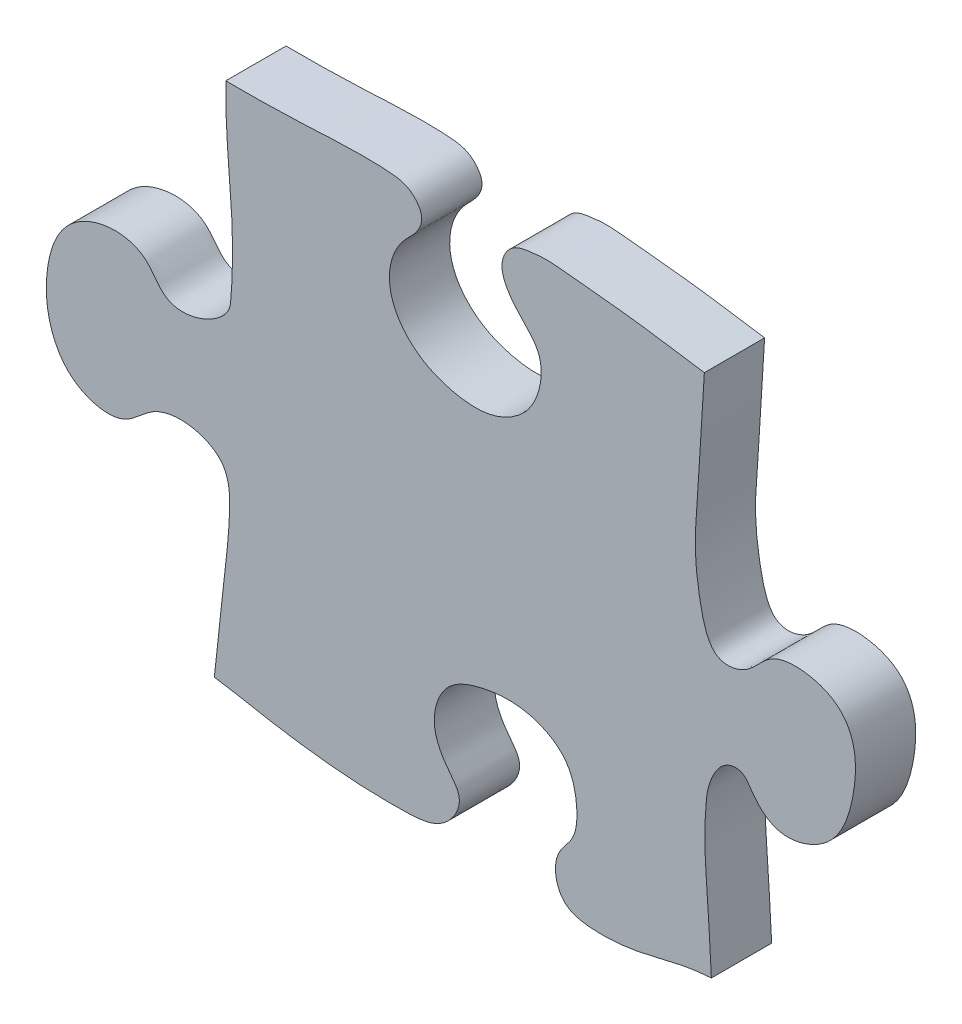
ISO-10303-21;
HEADER;
FILE_DESCRIPTION(('STEP AP214'),'2;1');
FILE_NAME('part.step','',(''),(''),'','','');
FILE_SCHEMA(('AUTOMOTIVE_DESIGN { 1 0 10303 214 1 1 1 1 }'));
ENDSEC;
DATA;
#1=APPLICATION_CONTEXT('core data for automotive mechanical design processes');
#2=APPLICATION_PROTOCOL_DEFINITION('international standard','automotive_design',2000,#1);
#3=PRODUCT_CONTEXT('',#1,'mechanical');
#4=PRODUCT('Part','Part','',(#3));
#5=PRODUCT_RELATED_PRODUCT_CATEGORY('part','',(#4));
#6=PRODUCT_DEFINITION_FORMATION('','',#4);
#7=PRODUCT_DEFINITION_CONTEXT('part definition',#1,'design');
#8=PRODUCT_DEFINITION('design','',#6,#7);
#9=PRODUCT_DEFINITION_SHAPE('','',#8);
#10=(LENGTH_UNIT() NAMED_UNIT(*) SI_UNIT(.MILLI.,.METRE.));
#11=(NAMED_UNIT(*) PLANE_ANGLE_UNIT() SI_UNIT($,.RADIAN.));
#12=(NAMED_UNIT(*) SI_UNIT($,.STERADIAN.) SOLID_ANGLE_UNIT());
#13=UNCERTAINTY_MEASURE_WITH_UNIT(LENGTH_MEASURE(1.E-05),#10,'distance_accuracy_value','');
#14=(GEOMETRIC_REPRESENTATION_CONTEXT(3) GLOBAL_UNCERTAINTY_ASSIGNED_CONTEXT((#13)) GLOBAL_UNIT_ASSIGNED_CONTEXT((#10,
#11,#12)) REPRESENTATION_CONTEXT('',''));
#15=CARTESIAN_POINT('',(0.,0.,0.));
#16=DIRECTION('',(0.,0.,1.));
#17=DIRECTION('',(1.,0.,0.));
#18=AXIS2_PLACEMENT_3D('',#15,#16,#17);
#19=CARTESIAN_POINT('',(-186.393246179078,356.,-0.00999999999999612));
#20=CARTESIAN_POINT('',(-186.465644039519,346.788250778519,-0.00999999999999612));
#21=CARTESIAN_POINT('',(-188.628884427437,329.478394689,-0.00999999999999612));
#22=CARTESIAN_POINT('',(-190.429976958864,304.816732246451,-0.00999999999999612));
#23=CARTESIAN_POINT('',(-187.884620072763,287.022607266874,-0.00999999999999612));
#24=CARTESIAN_POINT('',(-177.83183487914,273.701157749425,-0.00999999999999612));
#25=CARTESIAN_POINT('',(-167.372440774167,281.069990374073,-0.00999999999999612));
#26=CARTESIAN_POINT('',(-162.424812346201,293.671302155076,-0.00999999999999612));
#27=CARTESIAN_POINT('',(-138.980403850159,295.954762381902,-0.00999999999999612));
#28=CARTESIAN_POINT('',(-129.023505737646,274.502332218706,-0.00999999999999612));
#29=CARTESIAN_POINT('',(-130.151753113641,256.130310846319,-0.00999999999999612));
#30=CARTESIAN_POINT('',(-138.180313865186,240.882815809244,-0.00999999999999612));
#31=CARTESIAN_POINT('',(-153.903325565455,237.974697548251,-0.00999999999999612));
#32=CARTESIAN_POINT('',(-162.781582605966,247.270783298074,-0.00999999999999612));
#33=CARTESIAN_POINT('',(-171.61954140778,254.983724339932,-0.00999999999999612));
#34=CARTESIAN_POINT('',(-186.267660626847,251.663377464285,-0.00999999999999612));
#35=CARTESIAN_POINT('',(-188.178219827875,226.271427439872,-0.00999999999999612));
#36=CARTESIAN_POINT('',(-186.828985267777,214.10322906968,-0.00999999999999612));
#37=CARTESIAN_POINT('',(-182.631402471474,181.666904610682,-0.00999999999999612));
#38=CARTESIAN_POINT('',(-187.119801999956,157.75465666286,-0.00999999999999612));
#39=CARTESIAN_POINT('',(-187.457937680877,142.904539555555,-0.00999999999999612));
#40=CARTESIAN_POINT('',(-184.089404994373,126.204275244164,-0.00999999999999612));
#41=CARTESIAN_POINT('',(-168.499206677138,126.488047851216,-0.00999999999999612));
#42=CARTESIAN_POINT('',(-158.423592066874,136.759079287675,-0.00999999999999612));
#43=CARTESIAN_POINT('',(-133.598254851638,130.460350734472,-0.00999999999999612));
#44=CARTESIAN_POINT('',(-132.174041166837,109.25711139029,-0.00999999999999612));
#45=CARTESIAN_POINT('',(-137.401430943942,84.0677449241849,-0.00999999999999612));
#46=CARTESIAN_POINT('',(-159.905312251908,82.8448138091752,-0.00999999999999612));
#47=CARTESIAN_POINT('',(-167.594499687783,95.2630828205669,-0.00999999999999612));
#48=CARTESIAN_POINT('',(-184.064608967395,90.371493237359,-0.00999999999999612));
#49=CARTESIAN_POINT('',(-186.999172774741,63.1173196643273,-0.00999999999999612));
#50=CARTESIAN_POINT('',(-188.17555036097,34.3474510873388,-0.00999999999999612));
#51=CARTESIAN_POINT('',(-189.520016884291,-1.94344937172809,-0.00999999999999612));
#52=CARTESIAN_POINT('',(-192.230906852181,-38.9111914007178,-0.00999999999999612));
#53=CARTESIAN_POINT('',(-193.196462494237,-56.4819013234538,-0.00999999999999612));
#54=CARTESIAN_POINT('',(-187.787083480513,-81.0819408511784,-0.00999999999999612));
#55=CARTESIAN_POINT('',(-174.027975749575,-78.613025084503,-0.00999999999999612));
#56=CARTESIAN_POINT('',(-167.64120428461,-66.7586676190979,-0.00999999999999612));
#57=CARTESIAN_POINT('',(-138.878579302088,-69.8200733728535,-0.00999999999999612));
#58=CARTESIAN_POINT('',(-138.315063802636,-94.39593724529,-0.00999999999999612));
#59=CARTESIAN_POINT('',(-145.951566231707,-114.49908529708,-0.00999999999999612));
#60=CARTESIAN_POINT('',(-163.555921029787,-121.175747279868,-0.00999999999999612));
#61=CARTESIAN_POINT('',(-172.11578880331,-114.919909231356,-0.00999999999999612));
#62=CARTESIAN_POINT('',(-176.485425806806,-107.364168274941,-0.00999999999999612));
#63=CARTESIAN_POINT('',(-184.309097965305,-107.607264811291,-0.00999999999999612));
#64=CARTESIAN_POINT('',(-188.561946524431,-116.100575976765,-0.00999999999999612));
#65=CARTESIAN_POINT('',(-189.834439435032,-132.751458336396,-0.00999999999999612));
#66=CARTESIAN_POINT('',(-188.899668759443,-143.69775261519,-0.00999999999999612));
#67=CARTESIAN_POINT('',(-186.87437190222,-176.639875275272,-0.00999999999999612));
#68=CARTESIAN_POINT('',(-187.115886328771,-188.95785352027,-0.00999999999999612));
#69=CARTESIAN_POINT('',(-184.068917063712,-208.490912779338,-0.00999999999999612));
#70=CARTESIAN_POINT('',(-184.462371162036,-228.434350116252,-0.00999999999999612));
#71=CARTESIAN_POINT('',(-182.717405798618,-241.744671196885,-0.00999999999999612));
#72=CARTESIAN_POINT('',(-190.107123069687,-258.646375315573,-0.00999999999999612));
#73=CARTESIAN_POINT('',(-204.50360377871,-253.849993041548,-0.00999999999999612));
#74=CARTESIAN_POINT('',(-211.768269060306,-241.698033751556,-0.00999999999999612));
#75=CARTESIAN_POINT('',(-230.141572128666,-243.165284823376,-0.00999999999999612));
#76=CARTESIAN_POINT('',(-238.864067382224,-259.702852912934,-0.00999999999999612));
#77=CARTESIAN_POINT('',(-237.82033634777,-276.944530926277,-0.00999999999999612));
#78=CARTESIAN_POINT('',(-229.688332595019,-293.402921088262,-0.00999999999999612));
#79=CARTESIAN_POINT('',(-210.804716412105,-298.51720908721,-0.00999999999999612));
#80=CARTESIAN_POINT('',(-204.725260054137,-287.600226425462,-0.00999999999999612));
#81=CARTESIAN_POINT('',(-198.130842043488,-278.388409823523,-0.00999999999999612));
#82=CARTESIAN_POINT('',(-189.724281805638,-288.428094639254,-0.00999999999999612));
#83=CARTESIAN_POINT('',(-185.110914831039,-304.121783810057,-0.00999999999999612));
#84=CARTESIAN_POINT('',(-188.504639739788,-328.326605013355,-0.00999999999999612));
#85=CARTESIAN_POINT('',(-188.031330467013,-347.655914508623,-0.00999999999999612));
#86=CARTESIAN_POINT('',(-188.197680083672,-356.,-0.00999999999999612));
#87=B_SPLINE_CURVE_WITH_KNOTS('',3,(#19,#20,#21,#22,#23,#24,#25,#26,#27,#28,#29,#30,#31,#32,#33,
#34,#35,#36,#37,#38,#39,#40,#41,#42,#43,#44,#45,#46,#47,#48,#49,#50,#51,#52,#53,#54,#55,#56,#57,
#58,#59,#60,#61,#62,#63,#64,#65,#66,#67,#68,#69,#70,#71,#72,#73,#74,#75,#76,#77,#78,#79,#80,#81,
#82,#83,#84,#85,#86),.UNSPECIFIED.,.F.,.F.,(4,1,1,1,1,1,1,1,1,1,1,1,1,1,1,1,1,1,1,1,1,1,1,1,1,1,
1,1,1,1,1,1,1,1,1,1,1,1,1,1,1,1,1,1,1,1,1,1,1,1,1,1,1,1,1,1,1,1,1,1,1,1,1,1,1,4),(0.,
0.0262331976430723,0.050560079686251,0.0695219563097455,0.0800713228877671,0.0885051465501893,
0.099482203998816,0.118619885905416,0.138837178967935,0.157899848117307,0.171291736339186,
0.185151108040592,0.19559453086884,0.206745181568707,0.217337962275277,0.230877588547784,
0.26409725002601,0.28835141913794,0.305292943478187,0.32505690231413,0.334743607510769,
0.348191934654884,0.358741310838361,0.375812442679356,0.401272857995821,0.416827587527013,
0.432882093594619,0.444490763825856,0.458014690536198,0.481063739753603,0.510647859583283,
0.548186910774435,0.587648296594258,0.610908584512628,0.621783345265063,0.631931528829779,
0.643591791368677,0.658807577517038,0.686126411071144,0.703957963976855,0.718649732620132,
0.731300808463,0.735266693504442,0.736591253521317,0.743662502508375,0.746501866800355,
0.76410099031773,0.785041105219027,0.790214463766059,0.812987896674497,0.817887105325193,
0.836359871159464,0.84408330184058,0.853053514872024,0.86313504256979,0.875355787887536,
0.885829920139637,0.902341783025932,0.912788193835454,0.926625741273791,0.934943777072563,
0.940543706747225,0.946912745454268,0.957064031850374,0.980148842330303,1.),.UNSPECIFIED.);
#88=DIRECTION('',(0.,0.,1.));
#89=VECTOR('',#88,1.);
#90=SURFACE_OF_LINEAR_EXTRUSION('',#87,#89);
#91=CARTESIAN_POINT('',(-186.393246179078,356.,20.));
#92=CARTESIAN_POINT('',(-186.465644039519,346.788250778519,20.));
#93=CARTESIAN_POINT('',(-188.628884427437,329.478394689,20.));
#94=CARTESIAN_POINT('',(-190.429976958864,304.816732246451,20.));
#95=CARTESIAN_POINT('',(-187.884620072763,287.022607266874,20.));
#96=CARTESIAN_POINT('',(-177.83183487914,273.701157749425,20.));
#97=CARTESIAN_POINT('',(-167.372440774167,281.069990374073,20.));
#98=CARTESIAN_POINT('',(-162.424812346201,293.671302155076,20.));
#99=CARTESIAN_POINT('',(-138.980403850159,295.954762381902,20.));
#100=CARTESIAN_POINT('',(-129.023505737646,274.502332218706,20.));
#101=CARTESIAN_POINT('',(-130.151753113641,256.130310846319,20.));
#102=CARTESIAN_POINT('',(-138.180313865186,240.882815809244,20.));
#103=CARTESIAN_POINT('',(-153.903325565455,237.974697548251,20.));
#104=CARTESIAN_POINT('',(-162.781582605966,247.270783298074,20.));
#105=CARTESIAN_POINT('',(-171.61954140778,254.983724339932,20.));
#106=CARTESIAN_POINT('',(-186.267660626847,251.663377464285,20.));
#107=CARTESIAN_POINT('',(-188.178219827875,226.271427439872,20.));
#108=CARTESIAN_POINT('',(-186.828985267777,214.10322906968,20.));
#109=CARTESIAN_POINT('',(-182.631402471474,181.666904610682,20.));
#110=CARTESIAN_POINT('',(-187.119801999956,157.75465666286,20.));
#111=CARTESIAN_POINT('',(-187.457937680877,142.904539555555,20.));
#112=CARTESIAN_POINT('',(-184.089404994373,126.204275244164,20.));
#113=CARTESIAN_POINT('',(-168.499206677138,126.488047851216,20.));
#114=CARTESIAN_POINT('',(-158.423592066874,136.759079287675,20.));
#115=CARTESIAN_POINT('',(-133.598254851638,130.460350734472,20.));
#116=CARTESIAN_POINT('',(-132.174041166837,109.25711139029,20.));
#117=CARTESIAN_POINT('',(-137.401430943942,84.0677449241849,20.));
#118=CARTESIAN_POINT('',(-159.905312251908,82.8448138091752,20.));
#119=CARTESIAN_POINT('',(-167.594499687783,95.2630828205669,20.));
#120=CARTESIAN_POINT('',(-184.064608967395,90.371493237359,20.));
#121=CARTESIAN_POINT('',(-186.999172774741,63.1173196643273,20.));
#122=CARTESIAN_POINT('',(-188.17555036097,34.3474510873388,20.));
#123=CARTESIAN_POINT('',(-189.520016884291,-1.94344937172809,20.));
#124=CARTESIAN_POINT('',(-192.230906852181,-38.9111914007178,20.));
#125=CARTESIAN_POINT('',(-193.196462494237,-56.4819013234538,20.));
#126=CARTESIAN_POINT('',(-187.787083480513,-81.0819408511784,20.));
#127=CARTESIAN_POINT('',(-174.027975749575,-78.613025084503,20.));
#128=CARTESIAN_POINT('',(-167.64120428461,-66.7586676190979,20.));
#129=CARTESIAN_POINT('',(-138.878579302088,-69.8200733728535,20.));
#130=CARTESIAN_POINT('',(-138.315063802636,-94.39593724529,20.));
#131=CARTESIAN_POINT('',(-145.951566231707,-114.49908529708,20.));
#132=CARTESIAN_POINT('',(-163.555921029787,-121.175747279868,20.));
#133=CARTESIAN_POINT('',(-172.11578880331,-114.919909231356,20.));
#134=CARTESIAN_POINT('',(-176.485425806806,-107.364168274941,20.));
#135=CARTESIAN_POINT('',(-184.309097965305,-107.607264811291,20.));
#136=CARTESIAN_POINT('',(-188.561946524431,-116.100575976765,20.));
#137=CARTESIAN_POINT('',(-189.834439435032,-132.751458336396,20.));
#138=CARTESIAN_POINT('',(-188.899668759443,-143.69775261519,20.));
#139=CARTESIAN_POINT('',(-186.87437190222,-176.639875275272,20.));
#140=CARTESIAN_POINT('',(-187.115886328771,-188.95785352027,20.));
#141=CARTESIAN_POINT('',(-184.068917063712,-208.490912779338,20.));
#142=CARTESIAN_POINT('',(-184.462371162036,-228.434350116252,20.));
#143=CARTESIAN_POINT('',(-182.717405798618,-241.744671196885,20.));
#144=CARTESIAN_POINT('',(-190.107123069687,-258.646375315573,20.));
#145=CARTESIAN_POINT('',(-204.50360377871,-253.849993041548,20.));
#146=CARTESIAN_POINT('',(-211.768269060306,-241.698033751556,20.));
#147=CARTESIAN_POINT('',(-230.141572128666,-243.165284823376,20.));
#148=CARTESIAN_POINT('',(-238.864067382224,-259.702852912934,20.));
#149=CARTESIAN_POINT('',(-237.82033634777,-276.944530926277,20.));
#150=CARTESIAN_POINT('',(-229.688332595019,-293.402921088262,20.));
#151=CARTESIAN_POINT('',(-210.804716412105,-298.51720908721,20.));
#152=CARTESIAN_POINT('',(-204.725260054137,-287.600226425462,20.));
#153=CARTESIAN_POINT('',(-198.130842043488,-278.388409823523,20.));
#154=CARTESIAN_POINT('',(-189.724281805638,-288.428094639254,20.));
#155=CARTESIAN_POINT('',(-185.110914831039,-304.121783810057,20.));
#156=CARTESIAN_POINT('',(-188.504639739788,-328.326605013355,20.));
#157=CARTESIAN_POINT('',(-188.031330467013,-347.655914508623,20.));
#158=CARTESIAN_POINT('',(-188.197680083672,-356.,20.));
#159=B_SPLINE_CURVE_WITH_KNOTS('',3,(#91,#92,#93,#94,#95,#96,#97,#98,#99,#100,#101,#102,#103,
#104,#105,#106,#107,#108,#109,#110,#111,#112,#113,#114,#115,#116,#117,#118,#119,#120,#121,#122,
#123,#124,#125,#126,#127,#128,#129,#130,#131,#132,#133,#134,#135,#136,#137,#138,#139,#140,#141,
#142,#143,#144,#145,#146,#147,#148,#149,#150,#151,#152,#153,#154,#155,#156,#157,#158),
.UNSPECIFIED.,.F.,.F.,(4,1,1,1,1,1,1,1,1,1,1,1,1,1,1,1,1,1,1,1,1,1,1,1,1,1,1,1,1,1,1,1,1,1,1,1,
1,1,1,1,1,1,1,1,1,1,1,1,1,1,1,1,1,1,1,1,1,1,1,1,1,1,1,1,1,4),(0.,0.0262331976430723,
0.050560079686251,0.0695219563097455,0.0800713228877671,0.0885051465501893,0.099482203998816,
0.118619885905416,0.138837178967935,0.157899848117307,0.171291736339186,0.185151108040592,
0.19559453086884,0.206745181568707,0.217337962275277,0.230877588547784,0.26409725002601,
0.28835141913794,0.305292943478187,0.32505690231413,0.334743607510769,0.348191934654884,
0.358741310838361,0.375812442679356,0.401272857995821,0.416827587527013,0.432882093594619,
0.444490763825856,0.458014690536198,0.481063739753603,0.510647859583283,0.548186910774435,
0.587648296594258,0.610908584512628,0.621783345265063,0.631931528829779,0.643591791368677,
0.658807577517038,0.686126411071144,0.703957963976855,0.718649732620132,0.731300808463,
0.735266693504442,0.736591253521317,0.743662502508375,0.746501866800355,0.76410099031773,
0.785041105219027,0.790214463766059,0.812987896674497,0.817887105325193,0.836359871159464,
0.84408330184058,0.853053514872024,0.86313504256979,0.875355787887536,0.885829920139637,
0.902341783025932,0.912788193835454,0.926625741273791,0.934943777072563,0.940543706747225,
0.946912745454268,0.957064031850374,0.980148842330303,1.),.UNSPECIFIED.);
#160=CARTESIAN_POINT('',(-189.617340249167,0.816183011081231,20.));
#161=VERTEX_POINT('',#160);
#162=CARTESIAN_POINT('',(-187.287524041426,-171.956059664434,20.));
#163=VERTEX_POINT('',#162);
#164=EDGE_CURVE('E90',#161,#163,#159,.T.);
#165=ORIENTED_EDGE('',*,*,#164,.T.);
#166=DIRECTION('',(0.,0.,1.));
#167=VECTOR('',#166,1.);
#168=CARTESIAN_POINT('',(-187.287524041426,-171.956059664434,-0.00999999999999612));
#169=LINE('',#168,#167);
#170=CARTESIAN_POINT('',(-187.287524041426,-171.956059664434,0.));
#171=VERTEX_POINT('',#170);
#172=EDGE_CURVE('E80',#163,#171,#169,.F.);
#173=ORIENTED_EDGE('',*,*,#172,.T.);
#174=CARTESIAN_POINT('',(-186.393246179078,356.,0.));
#175=CARTESIAN_POINT('',(-186.465644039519,346.788250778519,0.));
#176=CARTESIAN_POINT('',(-188.628884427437,329.478394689,0.));
#177=CARTESIAN_POINT('',(-190.429976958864,304.816732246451,0.));
#178=CARTESIAN_POINT('',(-187.884620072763,287.022607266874,0.));
#179=CARTESIAN_POINT('',(-177.83183487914,273.701157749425,0.));
#180=CARTESIAN_POINT('',(-167.372440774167,281.069990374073,0.));
#181=CARTESIAN_POINT('',(-162.424812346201,293.671302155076,0.));
#182=CARTESIAN_POINT('',(-138.980403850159,295.954762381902,0.));
#183=CARTESIAN_POINT('',(-129.023505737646,274.502332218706,0.));
#184=CARTESIAN_POINT('',(-130.151753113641,256.130310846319,0.));
#185=CARTESIAN_POINT('',(-138.180313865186,240.882815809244,0.));
#186=CARTESIAN_POINT('',(-153.903325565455,237.974697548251,0.));
#187=CARTESIAN_POINT('',(-162.781582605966,247.270783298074,0.));
#188=CARTESIAN_POINT('',(-171.61954140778,254.983724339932,0.));
#189=CARTESIAN_POINT('',(-186.267660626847,251.663377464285,0.));
#190=CARTESIAN_POINT('',(-188.178219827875,226.271427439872,0.));
#191=CARTESIAN_POINT('',(-186.828985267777,214.10322906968,0.));
#192=CARTESIAN_POINT('',(-182.631402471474,181.666904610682,0.));
#193=CARTESIAN_POINT('',(-187.119801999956,157.75465666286,0.));
#194=CARTESIAN_POINT('',(-187.457937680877,142.904539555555,0.));
#195=CARTESIAN_POINT('',(-184.089404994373,126.204275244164,0.));
#196=CARTESIAN_POINT('',(-168.499206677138,126.488047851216,0.));
#197=CARTESIAN_POINT('',(-158.423592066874,136.759079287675,0.));
#198=CARTESIAN_POINT('',(-133.598254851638,130.460350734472,0.));
#199=CARTESIAN_POINT('',(-132.174041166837,109.25711139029,0.));
#200=CARTESIAN_POINT('',(-137.401430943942,84.0677449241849,0.));
#201=CARTESIAN_POINT('',(-159.905312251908,82.8448138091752,0.));
#202=CARTESIAN_POINT('',(-167.594499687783,95.2630828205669,0.));
#203=CARTESIAN_POINT('',(-184.064608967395,90.371493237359,0.));
#204=CARTESIAN_POINT('',(-186.999172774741,63.1173196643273,0.));
#205=CARTESIAN_POINT('',(-188.17555036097,34.3474510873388,0.));
#206=CARTESIAN_POINT('',(-189.520016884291,-1.94344937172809,0.));
#207=CARTESIAN_POINT('',(-192.230906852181,-38.9111914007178,0.));
#208=CARTESIAN_POINT('',(-193.196462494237,-56.4819013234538,0.));
#209=CARTESIAN_POINT('',(-187.787083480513,-81.0819408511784,0.));
#210=CARTESIAN_POINT('',(-174.027975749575,-78.613025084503,0.));
#211=CARTESIAN_POINT('',(-167.64120428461,-66.7586676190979,0.));
#212=CARTESIAN_POINT('',(-138.878579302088,-69.8200733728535,0.));
#213=CARTESIAN_POINT('',(-138.315063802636,-94.39593724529,0.));
#214=CARTESIAN_POINT('',(-145.951566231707,-114.49908529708,0.));
#215=CARTESIAN_POINT('',(-163.555921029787,-121.175747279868,0.));
#216=CARTESIAN_POINT('',(-172.11578880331,-114.919909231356,0.));
#217=CARTESIAN_POINT('',(-176.485425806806,-107.364168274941,0.));
#218=CARTESIAN_POINT('',(-184.309097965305,-107.607264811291,0.));
#219=CARTESIAN_POINT('',(-188.561946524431,-116.100575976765,0.));
#220=CARTESIAN_POINT('',(-189.834439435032,-132.751458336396,0.));
#221=CARTESIAN_POINT('',(-188.899668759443,-143.69775261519,0.));
#222=CARTESIAN_POINT('',(-186.87437190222,-176.639875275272,0.));
#223=CARTESIAN_POINT('',(-187.115886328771,-188.95785352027,0.));
#224=CARTESIAN_POINT('',(-184.068917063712,-208.490912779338,0.));
#225=CARTESIAN_POINT('',(-184.462371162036,-228.434350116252,0.));
#226=CARTESIAN_POINT('',(-182.717405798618,-241.744671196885,0.));
#227=CARTESIAN_POINT('',(-190.107123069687,-258.646375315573,0.));
#228=CARTESIAN_POINT('',(-204.50360377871,-253.849993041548,0.));
#229=CARTESIAN_POINT('',(-211.768269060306,-241.698033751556,0.));
#230=CARTESIAN_POINT('',(-230.141572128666,-243.165284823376,0.));
#231=CARTESIAN_POINT('',(-238.864067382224,-259.702852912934,0.));
#232=CARTESIAN_POINT('',(-237.82033634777,-276.944530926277,0.));
#233=CARTESIAN_POINT('',(-229.688332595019,-293.402921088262,0.));
#234=CARTESIAN_POINT('',(-210.804716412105,-298.51720908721,0.));
#235=CARTESIAN_POINT('',(-204.725260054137,-287.600226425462,0.));
#236=CARTESIAN_POINT('',(-198.130842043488,-278.388409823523,0.));
#237=CARTESIAN_POINT('',(-189.724281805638,-288.428094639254,0.));
#238=CARTESIAN_POINT('',(-185.110914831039,-304.121783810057,0.));
#239=CARTESIAN_POINT('',(-188.504639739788,-328.326605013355,0.));
#240=CARTESIAN_POINT('',(-188.031330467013,-347.655914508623,0.));
#241=CARTESIAN_POINT('',(-188.197680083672,-356.,0.));
#242=B_SPLINE_CURVE_WITH_KNOTS('',3,(#174,#175,#176,#177,#178,#179,#180,#181,#182,#183,#184,
#185,#186,#187,#188,#189,#190,#191,#192,#193,#194,#195,#196,#197,#198,#199,#200,#201,#202,#203,
#204,#205,#206,#207,#208,#209,#210,#211,#212,#213,#214,#215,#216,#217,#218,#219,#220,#221,#222,
#223,#224,#225,#226,#227,#228,#229,#230,#231,#232,#233,#234,#235,#236,#237,#238,#239,#240,#241),
.UNSPECIFIED.,.F.,.F.,(4,1,1,1,1,1,1,1,1,1,1,1,1,1,1,1,1,1,1,1,1,1,1,1,1,1,1,1,1,1,1,1,1,1,1,1,
1,1,1,1,1,1,1,1,1,1,1,1,1,1,1,1,1,1,1,1,1,1,1,1,1,1,1,1,1,4),(0.,0.0262331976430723,
0.050560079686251,0.0695219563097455,0.0800713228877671,0.0885051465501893,0.099482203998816,
0.118619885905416,0.138837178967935,0.157899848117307,0.171291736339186,0.185151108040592,
0.19559453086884,0.206745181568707,0.217337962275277,0.230877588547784,0.26409725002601,
0.28835141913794,0.305292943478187,0.32505690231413,0.334743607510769,0.348191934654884,
0.358741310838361,0.375812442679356,0.401272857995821,0.416827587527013,0.432882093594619,
0.444490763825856,0.458014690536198,0.481063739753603,0.510647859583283,0.548186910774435,
0.587648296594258,0.610908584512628,0.621783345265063,0.631931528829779,0.643591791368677,
0.658807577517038,0.686126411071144,0.703957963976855,0.718649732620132,0.731300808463,
0.735266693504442,0.736591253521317,0.743662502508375,0.746501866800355,0.76410099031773,
0.785041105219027,0.790214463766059,0.812987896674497,0.817887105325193,0.836359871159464,
0.84408330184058,0.853053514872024,0.86313504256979,0.875355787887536,0.885829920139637,
0.902341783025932,0.912788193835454,0.926625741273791,0.934943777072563,0.940543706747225,
0.946912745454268,0.957064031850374,0.980148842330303,1.),.UNSPECIFIED.);
#243=CARTESIAN_POINT('',(-189.617340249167,0.816183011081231,0.));
#244=VERTEX_POINT('',#243);
#245=EDGE_CURVE('E122',#244,#171,#242,.T.);
#246=ORIENTED_EDGE('',*,*,#245,.F.);
#247=DIRECTION('',(0.,0.,1.));
#248=VECTOR('',#247,1.);
#249=CARTESIAN_POINT('',(-189.617340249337,0.816183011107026,-0.00999999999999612));
#250=LINE('',#249,#248);
#251=EDGE_CURVE('E91',#161,#244,#250,.F.);
#252=ORIENTED_EDGE('',*,*,#251,.F.);
#253=EDGE_LOOP('',(#165,#173,#246,#252));
#254=FACE_BOUND('',#253,.T.);
#255=ADVANCED_FACE('F34',(#254),#90,.F.);
#256=CARTESIAN_POINT('',(-352.534626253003,356.,-0.00999999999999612));
#257=CARTESIAN_POINT('',(-353.877781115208,341.802611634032,-0.00999999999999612));
#258=CARTESIAN_POINT('',(-351.460483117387,322.567956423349,-0.00999999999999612));
#259=CARTESIAN_POINT('',(-355.747404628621,299.493999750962,-0.00999999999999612));
#260=CARTESIAN_POINT('',(-347.645743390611,289.357079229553,-0.00999999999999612));
#261=CARTESIAN_POINT('',(-337.80105524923,293.322704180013,-0.00999999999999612));
#262=CARTESIAN_POINT('',(-331.763521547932,304.464683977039,-0.00999999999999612));
#263=CARTESIAN_POINT('',(-312.737993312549,300.417040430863,-0.00999999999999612));
#264=CARTESIAN_POINT('',(-304.311514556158,284.867329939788,-0.00999999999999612));
#265=CARTESIAN_POINT('',(-301.362858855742,267.518539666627,-0.00999999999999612));
#266=CARTESIAN_POINT('',(-309.525260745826,253.299800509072,-0.00999999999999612));
#267=CARTESIAN_POINT('',(-323.085028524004,249.130779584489,-0.00999999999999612));
#268=CARTESIAN_POINT('',(-333.558735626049,254.453066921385,-0.00999999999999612));
#269=CARTESIAN_POINT('',(-338.061007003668,263.306234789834,-0.00999999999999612));
#270=CARTESIAN_POINT('',(-357.610347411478,266.663664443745,-0.00999999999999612));
#271=CARTESIAN_POINT('',(-352.91397083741,227.568949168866,-0.00999999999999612));
#272=CARTESIAN_POINT('',(-349.689076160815,203.209436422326,-0.00999999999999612));
#273=CARTESIAN_POINT('',(-346.386977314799,175.800103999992,-0.00999999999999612));
#274=CARTESIAN_POINT('',(-343.691373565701,150.269708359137,-0.00999999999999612));
#275=CARTESIAN_POINT('',(-342.931567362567,128.594211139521,-0.00999999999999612));
#276=CARTESIAN_POINT('',(-343.655360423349,107.633085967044,-0.00999999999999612));
#277=CARTESIAN_POINT('',(-357.389603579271,103.824438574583,-0.00999999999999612));
#278=CARTESIAN_POINT('',(-367.576419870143,106.015828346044,-0.00999999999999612));
#279=CARTESIAN_POINT('',(-371.765750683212,114.589953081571,-0.00999999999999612));
#280=CARTESIAN_POINT('',(-382.535012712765,116.182843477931,-0.00999999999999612));
#281=CARTESIAN_POINT('',(-394.783984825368,115.916744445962,-0.00999999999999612));
#282=CARTESIAN_POINT('',(-402.322369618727,104.396558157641,-0.00999999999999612));
#283=CARTESIAN_POINT('',(-405.688784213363,89.1486295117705,-0.00999999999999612));
#284=CARTESIAN_POINT('',(-402.964002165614,71.2455616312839,-0.00999999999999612));
#285=CARTESIAN_POINT('',(-389.022909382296,60.8761001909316,-0.00999999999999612));
#286=CARTESIAN_POINT('',(-377.013010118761,63.0649709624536,-0.00999999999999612));
#287=CARTESIAN_POINT('',(-370.136212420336,70.9200889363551,-0.00999999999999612));
#288=CARTESIAN_POINT('',(-359.248489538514,74.3793713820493,-0.00999999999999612));
#289=CARTESIAN_POINT('',(-347.964757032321,70.4189230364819,-0.00999999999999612));
#290=CARTESIAN_POINT('',(-342.961480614,58.8762689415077,-0.00999999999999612));
#291=CARTESIAN_POINT('',(-344.957853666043,42.6141567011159,-0.00999999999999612));
#292=CARTESIAN_POINT('',(-348.090347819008,20.9428011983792,-0.00999999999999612));
#293=CARTESIAN_POINT('',(-348.787112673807,-1.92187291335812,-0.00999999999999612));
#294=CARTESIAN_POINT('',(-347.063507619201,-23.1354473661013,-0.00999999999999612));
#295=CARTESIAN_POINT('',(-345.803834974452,-40.1989543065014,-0.00999999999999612));
#296=CARTESIAN_POINT('',(-346.365109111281,-52.5147126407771,-0.00999999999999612));
#297=CARTESIAN_POINT('',(-346.987719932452,-61.0081322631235,-0.00999999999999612));
#298=CARTESIAN_POINT('',(-354.605588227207,-67.8105997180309,-0.00999999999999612));
#299=CARTESIAN_POINT('',(-368.483652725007,-69.9483525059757,-0.00999999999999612));
#300=CARTESIAN_POINT('',(-374.929468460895,-56.6181815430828,-0.00999999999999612));
#301=CARTESIAN_POINT('',(-389.51528778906,-54.9578642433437,-0.00999999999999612));
#302=CARTESIAN_POINT('',(-403.927113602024,-62.7741481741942,-0.00999999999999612));
#303=CARTESIAN_POINT('',(-408.906740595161,-79.6272624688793,-0.00999999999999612));
#304=CARTESIAN_POINT('',(-407.354009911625,-95.181625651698,-0.00999999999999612));
#305=CARTESIAN_POINT('',(-399.108136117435,-108.127376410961,-0.00999999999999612));
#306=CARTESIAN_POINT('',(-382.721304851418,-112.332091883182,-0.00999999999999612));
#307=CARTESIAN_POINT('',(-372.627066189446,-99.6029758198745,-0.00999999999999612));
#308=CARTESIAN_POINT('',(-359.245942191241,-98.6507630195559,-0.00999999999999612));
#309=CARTESIAN_POINT('',(-346.811479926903,-105.357996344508,-0.00999999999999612));
#310=CARTESIAN_POINT('',(-347.06309899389,-122.824759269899,-0.00999999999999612));
#311=CARTESIAN_POINT('',(-349.512128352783,-142.867981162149,-0.00999999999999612));
#312=CARTESIAN_POINT('',(-351.967561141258,-164.813498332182,-0.00999999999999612));
#313=CARTESIAN_POINT('',(-354.173348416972,-189.531702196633,-0.00999999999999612));
#314=CARTESIAN_POINT('',(-353.048503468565,-212.668893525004,-0.00999999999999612));
#315=CARTESIAN_POINT('',(-354.739062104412,-232.840407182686,-0.00999999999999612));
#316=CARTESIAN_POINT('',(-344.245211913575,-244.921596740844,-0.00999999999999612));
#317=CARTESIAN_POINT('',(-336.376475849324,-237.735778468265,-0.00999999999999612));
#318=CARTESIAN_POINT('',(-333.938993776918,-228.321764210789,-0.00999999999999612));
#319=CARTESIAN_POINT('',(-321.423877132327,-226.689197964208,-0.00999999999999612));
#320=CARTESIAN_POINT('',(-310.83224361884,-232.911014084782,-0.00999999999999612));
#321=CARTESIAN_POINT('',(-302.540379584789,-246.611975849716,-0.00999999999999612));
#322=CARTESIAN_POINT('',(-304.049270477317,-262.348985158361,-0.00999999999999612));
#323=CARTESIAN_POINT('',(-307.19247660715,-276.895908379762,-0.00999999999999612));
#324=CARTESIAN_POINT('',(-317.916754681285,-281.774853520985,-0.00999999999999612));
#325=CARTESIAN_POINT('',(-328.48323529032,-282.130896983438,-0.00999999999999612));
#326=CARTESIAN_POINT('',(-335.177873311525,-274.391757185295,-0.00999999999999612));
#327=CARTESIAN_POINT('',(-340.967044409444,-267.020526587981,-0.00999999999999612));
#328=CARTESIAN_POINT('',(-352.493784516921,-268.657509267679,-0.00999999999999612));
#329=CARTESIAN_POINT('',(-357.686319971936,-282.822093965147,-0.00999999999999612));
#330=CARTESIAN_POINT('',(-357.597756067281,-311.53856504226,-0.00999999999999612));
#331=CARTESIAN_POINT('',(-355.656952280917,-337.76537977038,-0.00999999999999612));
#332=CARTESIAN_POINT('',(-354.035135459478,-356.,-0.00999999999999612));
#333=B_SPLINE_CURVE_WITH_KNOTS('',3,(#256,#257,#258,#259,#260,#261,#262,#263,#264,#265,#266,
#267,#268,#269,#270,#271,#272,#273,#274,#275,#276,#277,#278,#279,#280,#281,#282,#283,#284,#285,
#286,#287,#288,#289,#290,#291,#292,#293,#294,#295,#296,#297,#298,#299,#300,#301,#302,#303,#304,
#305,#306,#307,#308,#309,#310,#311,#312,#313,#314,#315,#316,#317,#318,#319,#320,#321,#322,#323,
#324,#325,#326,#327,#328,#329,#330,#331,#332),.UNSPECIFIED.,.F.,.F.,(4,1,1,1,1,1,1,1,1,1,1,1,1,
1,1,1,1,1,1,1,1,1,1,1,1,1,1,1,1,1,1,1,1,1,1,1,1,1,1,1,1,1,1,1,1,1,1,1,1,1,1,1,1,1,1,1,1,1,1,1,1,
1,1,1,1,1,1,1,1,1,1,1,1,1,4),(0.,0.0362663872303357,0.0516957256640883,0.0575126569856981,
0.0656061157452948,0.0738542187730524,0.0886191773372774,0.103761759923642,0.118344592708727,
0.132658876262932,0.141706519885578,0.152628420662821,0.159936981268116,0.166346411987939,
0.196099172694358,0.222591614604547,0.242329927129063,0.265519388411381,0.28892287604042,
0.3014399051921,0.313339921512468,0.3200215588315,0.327007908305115,0.335496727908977,
0.346341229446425,0.356695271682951,0.367736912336,0.387395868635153,0.399447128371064,
0.408443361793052,0.416078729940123,0.425886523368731,0.4364139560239,0.44355209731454,
0.456701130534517,0.478081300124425,0.500737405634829,0.515722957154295,0.53328305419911,
0.545176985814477,0.547408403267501,0.555597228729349,0.568417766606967,0.576959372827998,
0.589646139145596,0.601337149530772,0.617107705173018,0.631663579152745,0.64088779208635,
0.655943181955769,0.666193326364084,0.679689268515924,0.687162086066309,0.700019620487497,
0.719317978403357,0.742088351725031,0.756487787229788,0.783860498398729,0.801622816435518,
0.8097052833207,0.815461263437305,0.824516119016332,0.833497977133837,0.842909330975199,
0.85562007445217,0.872330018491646,0.883598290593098,0.890881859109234,0.901363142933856,
0.908021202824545,0.916645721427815,0.924017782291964,0.933106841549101,0.95201687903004,1.),.UNSPECIFIED.);
#334=DIRECTION('',(0.,0.,1.));
#335=VECTOR('',#334,1.);
#336=SURFACE_OF_LINEAR_EXTRUSION('',#333,#335);
#337=CARTESIAN_POINT('',(-352.534626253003,356.,20.));
#338=CARTESIAN_POINT('',(-353.877781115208,341.802611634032,20.));
#339=CARTESIAN_POINT('',(-351.460483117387,322.567956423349,20.));
#340=CARTESIAN_POINT('',(-355.747404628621,299.493999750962,20.));
#341=CARTESIAN_POINT('',(-347.645743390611,289.357079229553,20.));
#342=CARTESIAN_POINT('',(-337.80105524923,293.322704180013,20.));
#343=CARTESIAN_POINT('',(-331.763521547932,304.464683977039,20.));
#344=CARTESIAN_POINT('',(-312.737993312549,300.417040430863,20.));
#345=CARTESIAN_POINT('',(-304.311514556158,284.867329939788,20.));
#346=CARTESIAN_POINT('',(-301.362858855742,267.518539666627,20.));
#347=CARTESIAN_POINT('',(-309.525260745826,253.299800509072,20.));
#348=CARTESIAN_POINT('',(-323.085028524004,249.130779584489,20.));
#349=CARTESIAN_POINT('',(-333.558735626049,254.453066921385,20.));
#350=CARTESIAN_POINT('',(-338.061007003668,263.306234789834,20.));
#351=CARTESIAN_POINT('',(-357.610347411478,266.663664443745,20.));
#352=CARTESIAN_POINT('',(-352.91397083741,227.568949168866,20.));
#353=CARTESIAN_POINT('',(-349.689076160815,203.209436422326,20.));
#354=CARTESIAN_POINT('',(-346.386977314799,175.800103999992,20.));
#355=CARTESIAN_POINT('',(-343.691373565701,150.269708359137,20.));
#356=CARTESIAN_POINT('',(-342.931567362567,128.594211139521,20.));
#357=CARTESIAN_POINT('',(-343.655360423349,107.633085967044,20.));
#358=CARTESIAN_POINT('',(-357.389603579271,103.824438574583,20.));
#359=CARTESIAN_POINT('',(-367.576419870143,106.015828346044,20.));
#360=CARTESIAN_POINT('',(-371.765750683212,114.589953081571,20.));
#361=CARTESIAN_POINT('',(-382.535012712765,116.182843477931,20.));
#362=CARTESIAN_POINT('',(-394.783984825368,115.916744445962,20.));
#363=CARTESIAN_POINT('',(-402.322369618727,104.396558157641,20.));
#364=CARTESIAN_POINT('',(-405.688784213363,89.1486295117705,20.));
#365=CARTESIAN_POINT('',(-402.964002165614,71.2455616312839,20.));
#366=CARTESIAN_POINT('',(-389.022909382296,60.8761001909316,20.));
#367=CARTESIAN_POINT('',(-377.013010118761,63.0649709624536,20.));
#368=CARTESIAN_POINT('',(-370.136212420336,70.9200889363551,20.));
#369=CARTESIAN_POINT('',(-359.248489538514,74.3793713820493,20.));
#370=CARTESIAN_POINT('',(-347.964757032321,70.4189230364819,20.));
#371=CARTESIAN_POINT('',(-342.961480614,58.8762689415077,20.));
#372=CARTESIAN_POINT('',(-344.957853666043,42.6141567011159,20.));
#373=CARTESIAN_POINT('',(-348.090347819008,20.9428011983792,20.));
#374=CARTESIAN_POINT('',(-348.787112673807,-1.92187291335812,20.));
#375=CARTESIAN_POINT('',(-347.063507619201,-23.1354473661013,20.));
#376=CARTESIAN_POINT('',(-345.803834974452,-40.1989543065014,20.));
#377=CARTESIAN_POINT('',(-346.365109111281,-52.5147126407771,20.));
#378=CARTESIAN_POINT('',(-346.987719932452,-61.0081322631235,20.));
#379=CARTESIAN_POINT('',(-354.605588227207,-67.8105997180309,20.));
#380=CARTESIAN_POINT('',(-368.483652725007,-69.9483525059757,20.));
#381=CARTESIAN_POINT('',(-374.929468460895,-56.6181815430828,20.));
#382=CARTESIAN_POINT('',(-389.51528778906,-54.9578642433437,20.));
#383=CARTESIAN_POINT('',(-403.927113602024,-62.7741481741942,20.));
#384=CARTESIAN_POINT('',(-408.906740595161,-79.6272624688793,20.));
#385=CARTESIAN_POINT('',(-407.354009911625,-95.181625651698,20.));
#386=CARTESIAN_POINT('',(-399.108136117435,-108.127376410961,20.));
#387=CARTESIAN_POINT('',(-382.721304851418,-112.332091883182,20.));
#388=CARTESIAN_POINT('',(-372.627066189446,-99.6029758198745,20.));
#389=CARTESIAN_POINT('',(-359.245942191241,-98.6507630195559,20.));
#390=CARTESIAN_POINT('',(-346.811479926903,-105.357996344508,20.));
#391=CARTESIAN_POINT('',(-347.06309899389,-122.824759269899,20.));
#392=CARTESIAN_POINT('',(-349.512128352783,-142.867981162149,20.));
#393=CARTESIAN_POINT('',(-351.967561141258,-164.813498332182,20.));
#394=CARTESIAN_POINT('',(-354.173348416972,-189.531702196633,20.));
#395=CARTESIAN_POINT('',(-353.048503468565,-212.668893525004,20.));
#396=CARTESIAN_POINT('',(-354.739062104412,-232.840407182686,20.));
#397=CARTESIAN_POINT('',(-344.245211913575,-244.921596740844,20.));
#398=CARTESIAN_POINT('',(-336.376475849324,-237.735778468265,20.));
#399=CARTESIAN_POINT('',(-333.938993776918,-228.321764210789,20.));
#400=CARTESIAN_POINT('',(-321.423877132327,-226.689197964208,20.));
#401=CARTESIAN_POINT('',(-310.83224361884,-232.911014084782,20.));
#402=CARTESIAN_POINT('',(-302.540379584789,-246.611975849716,20.));
#403=CARTESIAN_POINT('',(-304.049270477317,-262.348985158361,20.));
#404=CARTESIAN_POINT('',(-307.19247660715,-276.895908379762,20.));
#405=CARTESIAN_POINT('',(-317.916754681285,-281.774853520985,20.));
#406=CARTESIAN_POINT('',(-328.48323529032,-282.130896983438,20.));
#407=CARTESIAN_POINT('',(-335.177873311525,-274.391757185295,20.));
#408=CARTESIAN_POINT('',(-340.967044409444,-267.020526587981,20.));
#409=CARTESIAN_POINT('',(-352.493784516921,-268.657509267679,20.));
#410=CARTESIAN_POINT('',(-357.686319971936,-282.822093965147,20.));
#411=CARTESIAN_POINT('',(-357.597756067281,-311.53856504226,20.));
#412=CARTESIAN_POINT('',(-355.656952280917,-337.76537977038,20.));
#413=CARTESIAN_POINT('',(-354.035135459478,-356.,20.));
#414=B_SPLINE_CURVE_WITH_KNOTS('',3,(#337,#338,#339,#340,#341,#342,#343,#344,#345,#346,#347,
#348,#349,#350,#351,#352,#353,#354,#355,#356,#357,#358,#359,#360,#361,#362,#363,#364,#365,#366,
#367,#368,#369,#370,#371,#372,#373,#374,#375,#376,#377,#378,#379,#380,#381,#382,#383,#384,#385,
#386,#387,#388,#389,#390,#391,#392,#393,#394,#395,#396,#397,#398,#399,#400,#401,#402,#403,#404,
#405,#406,#407,#408,#409,#410,#411,#412,#413),.UNSPECIFIED.,.F.,.F.,(4,1,1,1,1,1,1,1,1,1,1,1,1,
1,1,1,1,1,1,1,1,1,1,1,1,1,1,1,1,1,1,1,1,1,1,1,1,1,1,1,1,1,1,1,1,1,1,1,1,1,1,1,1,1,1,1,1,1,1,1,1,
1,1,1,1,1,1,1,1,1,1,1,1,1,4),(0.,0.0362663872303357,0.0516957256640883,0.0575126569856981,
0.0656061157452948,0.0738542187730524,0.0886191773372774,0.103761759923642,0.118344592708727,
0.132658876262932,0.141706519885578,0.152628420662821,0.159936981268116,0.166346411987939,
0.196099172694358,0.222591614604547,0.242329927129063,0.265519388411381,0.28892287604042,
0.3014399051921,0.313339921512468,0.3200215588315,0.327007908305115,0.335496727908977,
0.346341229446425,0.356695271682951,0.367736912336,0.387395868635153,0.399447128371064,
0.408443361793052,0.416078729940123,0.425886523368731,0.4364139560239,0.44355209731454,
0.456701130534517,0.478081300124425,0.500737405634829,0.515722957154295,0.53328305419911,
0.545176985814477,0.547408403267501,0.555597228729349,0.568417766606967,0.576959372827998,
0.589646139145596,0.601337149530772,0.617107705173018,0.631663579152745,0.64088779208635,
0.655943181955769,0.666193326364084,0.679689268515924,0.687162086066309,0.700019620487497,
0.719317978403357,0.742088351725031,0.756487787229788,0.783860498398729,0.801622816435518,
0.8097052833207,0.815461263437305,0.824516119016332,0.833497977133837,0.842909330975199,
0.85562007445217,0.872330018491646,0.883598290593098,0.890881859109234,0.901363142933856,
0.908021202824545,0.916645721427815,0.924017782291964,0.933106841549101,0.95201687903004,1.),.UNSPECIFIED.);
#415=CARTESIAN_POINT('',(-348.40314200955,5.28695656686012,20.));
#416=VERTEX_POINT('',#415);
#417=CARTESIAN_POINT('',(-352.201722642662,-167.987791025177,20.));
#418=VERTEX_POINT('',#417);
#419=EDGE_CURVE('E53',#416,#418,#414,.T.);
#420=ORIENTED_EDGE('',*,*,#419,.F.);
#421=DIRECTION('',(0.,0.,1.));
#422=VECTOR('',#421,1.);
#423=CARTESIAN_POINT('',(-348.403142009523,5.28695656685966,-0.00999999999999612));
#424=LINE('',#423,#422);
#425=CARTESIAN_POINT('',(-348.40314200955,5.28695656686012,0.));
#426=VERTEX_POINT('',#425);
#427=EDGE_CURVE('E87',#416,#426,#424,.F.);
#428=ORIENTED_EDGE('',*,*,#427,.T.);
#429=CARTESIAN_POINT('',(-352.534626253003,356.,0.));
#430=CARTESIAN_POINT('',(-353.877781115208,341.802611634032,0.));
#431=CARTESIAN_POINT('',(-351.460483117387,322.567956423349,0.));
#432=CARTESIAN_POINT('',(-355.747404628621,299.493999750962,0.));
#433=CARTESIAN_POINT('',(-347.645743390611,289.357079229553,0.));
#434=CARTESIAN_POINT('',(-337.80105524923,293.322704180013,0.));
#435=CARTESIAN_POINT('',(-331.763521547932,304.464683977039,0.));
#436=CARTESIAN_POINT('',(-312.737993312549,300.417040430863,0.));
#437=CARTESIAN_POINT('',(-304.311514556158,284.867329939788,0.));
#438=CARTESIAN_POINT('',(-301.362858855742,267.518539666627,0.));
#439=CARTESIAN_POINT('',(-309.525260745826,253.299800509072,0.));
#440=CARTESIAN_POINT('',(-323.085028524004,249.130779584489,0.));
#441=CARTESIAN_POINT('',(-333.558735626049,254.453066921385,0.));
#442=CARTESIAN_POINT('',(-338.061007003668,263.306234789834,0.));
#443=CARTESIAN_POINT('',(-357.610347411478,266.663664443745,0.));
#444=CARTESIAN_POINT('',(-352.91397083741,227.568949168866,0.));
#445=CARTESIAN_POINT('',(-349.689076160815,203.209436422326,0.));
#446=CARTESIAN_POINT('',(-346.386977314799,175.800103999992,0.));
#447=CARTESIAN_POINT('',(-343.691373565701,150.269708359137,0.));
#448=CARTESIAN_POINT('',(-342.931567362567,128.594211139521,0.));
#449=CARTESIAN_POINT('',(-343.655360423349,107.633085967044,0.));
#450=CARTESIAN_POINT('',(-357.389603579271,103.824438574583,0.));
#451=CARTESIAN_POINT('',(-367.576419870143,106.015828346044,0.));
#452=CARTESIAN_POINT('',(-371.765750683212,114.589953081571,0.));
#453=CARTESIAN_POINT('',(-382.535012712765,116.182843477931,0.));
#454=CARTESIAN_POINT('',(-394.783984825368,115.916744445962,0.));
#455=CARTESIAN_POINT('',(-402.322369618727,104.396558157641,0.));
#456=CARTESIAN_POINT('',(-405.688784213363,89.1486295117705,0.));
#457=CARTESIAN_POINT('',(-402.964002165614,71.2455616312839,0.));
#458=CARTESIAN_POINT('',(-389.022909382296,60.8761001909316,0.));
#459=CARTESIAN_POINT('',(-377.013010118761,63.0649709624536,0.));
#460=CARTESIAN_POINT('',(-370.136212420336,70.9200889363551,0.));
#461=CARTESIAN_POINT('',(-359.248489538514,74.3793713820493,0.));
#462=CARTESIAN_POINT('',(-347.964757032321,70.4189230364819,0.));
#463=CARTESIAN_POINT('',(-342.961480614,58.8762689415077,0.));
#464=CARTESIAN_POINT('',(-344.957853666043,42.6141567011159,0.));
#465=CARTESIAN_POINT('',(-348.090347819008,20.9428011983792,0.));
#466=CARTESIAN_POINT('',(-348.787112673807,-1.92187291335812,0.));
#467=CARTESIAN_POINT('',(-347.063507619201,-23.1354473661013,0.));
#468=CARTESIAN_POINT('',(-345.803834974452,-40.1989543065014,0.));
#469=CARTESIAN_POINT('',(-346.365109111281,-52.5147126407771,0.));
#470=CARTESIAN_POINT('',(-346.987719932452,-61.0081322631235,0.));
#471=CARTESIAN_POINT('',(-354.605588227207,-67.8105997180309,0.));
#472=CARTESIAN_POINT('',(-368.483652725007,-69.9483525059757,0.));
#473=CARTESIAN_POINT('',(-374.929468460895,-56.6181815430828,0.));
#474=CARTESIAN_POINT('',(-389.51528778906,-54.9578642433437,0.));
#475=CARTESIAN_POINT('',(-403.927113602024,-62.7741481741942,0.));
#476=CARTESIAN_POINT('',(-408.906740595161,-79.6272624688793,0.));
#477=CARTESIAN_POINT('',(-407.354009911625,-95.181625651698,0.));
#478=CARTESIAN_POINT('',(-399.108136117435,-108.127376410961,0.));
#479=CARTESIAN_POINT('',(-382.721304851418,-112.332091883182,0.));
#480=CARTESIAN_POINT('',(-372.627066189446,-99.6029758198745,0.));
#481=CARTESIAN_POINT('',(-359.245942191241,-98.6507630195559,0.));
#482=CARTESIAN_POINT('',(-346.811479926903,-105.357996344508,0.));
#483=CARTESIAN_POINT('',(-347.06309899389,-122.824759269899,0.));
#484=CARTESIAN_POINT('',(-349.512128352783,-142.867981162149,0.));
#485=CARTESIAN_POINT('',(-351.967561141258,-164.813498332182,0.));
#486=CARTESIAN_POINT('',(-354.173348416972,-189.531702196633,0.));
#487=CARTESIAN_POINT('',(-353.048503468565,-212.668893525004,0.));
#488=CARTESIAN_POINT('',(-354.739062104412,-232.840407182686,0.));
#489=CARTESIAN_POINT('',(-344.245211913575,-244.921596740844,0.));
#490=CARTESIAN_POINT('',(-336.376475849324,-237.735778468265,0.));
#491=CARTESIAN_POINT('',(-333.938993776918,-228.321764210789,0.));
#492=CARTESIAN_POINT('',(-321.423877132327,-226.689197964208,0.));
#493=CARTESIAN_POINT('',(-310.83224361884,-232.911014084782,0.));
#494=CARTESIAN_POINT('',(-302.540379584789,-246.611975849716,0.));
#495=CARTESIAN_POINT('',(-304.049270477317,-262.348985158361,0.));
#496=CARTESIAN_POINT('',(-307.19247660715,-276.895908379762,0.));
#497=CARTESIAN_POINT('',(-317.916754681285,-281.774853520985,0.));
#498=CARTESIAN_POINT('',(-328.48323529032,-282.130896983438,0.));
#499=CARTESIAN_POINT('',(-335.177873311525,-274.391757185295,0.));
#500=CARTESIAN_POINT('',(-340.967044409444,-267.020526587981,0.));
#501=CARTESIAN_POINT('',(-352.493784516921,-268.657509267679,0.));
#502=CARTESIAN_POINT('',(-357.686319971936,-282.822093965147,0.));
#503=CARTESIAN_POINT('',(-357.597756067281,-311.53856504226,0.));
#504=CARTESIAN_POINT('',(-355.656952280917,-337.76537977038,0.));
#505=CARTESIAN_POINT('',(-354.035135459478,-356.,0.));
#506=B_SPLINE_CURVE_WITH_KNOTS('',3,(#429,#430,#431,#432,#433,#434,#435,#436,#437,#438,#439,
#440,#441,#442,#443,#444,#445,#446,#447,#448,#449,#450,#451,#452,#453,#454,#455,#456,#457,#458,
#459,#460,#461,#462,#463,#464,#465,#466,#467,#468,#469,#470,#471,#472,#473,#474,#475,#476,#477,
#478,#479,#480,#481,#482,#483,#484,#485,#486,#487,#488,#489,#490,#491,#492,#493,#494,#495,#496,
#497,#498,#499,#500,#501,#502,#503,#504,#505),.UNSPECIFIED.,.F.,.F.,(4,1,1,1,1,1,1,1,1,1,1,1,1,
1,1,1,1,1,1,1,1,1,1,1,1,1,1,1,1,1,1,1,1,1,1,1,1,1,1,1,1,1,1,1,1,1,1,1,1,1,1,1,1,1,1,1,1,1,1,1,1,
1,1,1,1,1,1,1,1,1,1,1,1,1,4),(0.,0.0362663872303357,0.0516957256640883,0.0575126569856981,
0.0656061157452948,0.0738542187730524,0.0886191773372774,0.103761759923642,0.118344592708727,
0.132658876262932,0.141706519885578,0.152628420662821,0.159936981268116,0.166346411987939,
0.196099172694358,0.222591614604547,0.242329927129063,0.265519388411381,0.28892287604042,
0.3014399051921,0.313339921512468,0.3200215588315,0.327007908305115,0.335496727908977,
0.346341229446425,0.356695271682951,0.367736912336,0.387395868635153,0.399447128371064,
0.408443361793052,0.416078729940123,0.425886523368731,0.4364139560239,0.44355209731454,
0.456701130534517,0.478081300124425,0.500737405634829,0.515722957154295,0.53328305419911,
0.545176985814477,0.547408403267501,0.555597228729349,0.568417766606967,0.576959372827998,
0.589646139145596,0.601337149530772,0.617107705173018,0.631663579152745,0.64088779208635,
0.655943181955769,0.666193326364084,0.679689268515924,0.687162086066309,0.700019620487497,
0.719317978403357,0.742088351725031,0.756487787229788,0.783860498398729,0.801622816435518,
0.8097052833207,0.815461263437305,0.824516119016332,0.833497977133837,0.842909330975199,
0.85562007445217,0.872330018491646,0.883598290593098,0.890881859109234,0.901363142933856,
0.908021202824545,0.916645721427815,0.924017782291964,0.933106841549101,0.95201687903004,1.),.UNSPECIFIED.);
#507=CARTESIAN_POINT('',(-352.201722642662,-167.987791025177,0.));
#508=VERTEX_POINT('',#507);
#509=EDGE_CURVE('E38',#426,#508,#506,.T.);
#510=ORIENTED_EDGE('',*,*,#509,.T.);
#511=DIRECTION('',(0.,0.,1.));
#512=VECTOR('',#511,1.);
#513=CARTESIAN_POINT('',(-352.201722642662,-167.987791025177,-0.00999999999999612));
#514=LINE('',#513,#512);
#515=EDGE_CURVE('E119',#418,#508,#514,.F.);
#516=ORIENTED_EDGE('',*,*,#515,.F.);
#517=EDGE_LOOP('',(#420,#428,#510,#516));
#518=FACE_BOUND('',#517,.T.);
#519=ADVANCED_FACE('F145',(#518),#336,.T.);
#520=CARTESIAN_POINT('',(-512.,-172.519287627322,-0.00999999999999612));
#521=CARTESIAN_POINT('',(-502.879283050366,-170.962470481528,-0.00999999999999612));
#522=CARTESIAN_POINT('',(-487.788222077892,-168.37828827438,-0.00999999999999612));
#523=CARTESIAN_POINT('',(-467.037528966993,-166.739801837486,-0.00999999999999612));
#524=CARTESIAN_POINT('',(-454.159365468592,-165.446436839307,-0.00999999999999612));
#525=CARTESIAN_POINT('',(-444.971534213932,-166.107812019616,-0.00999999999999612));
#526=CARTESIAN_POINT('',(-439.850321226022,-171.772015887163,-0.00999999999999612));
#527=CARTESIAN_POINT('',(-440.374957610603,-181.037323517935,-0.00999999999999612));
#528=CARTESIAN_POINT('',(-446.328241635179,-187.391856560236,-0.00999999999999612));
#529=CARTESIAN_POINT('',(-453.905227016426,-194.752671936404,-0.00999999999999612));
#530=CARTESIAN_POINT('',(-453.078389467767,-207.700641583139,-0.00999999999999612));
#531=CARTESIAN_POINT('',(-447.147625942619,-218.930001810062,-0.00999999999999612));
#532=CARTESIAN_POINT('',(-435.337181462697,-224.50074852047,-0.00999999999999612));
#533=CARTESIAN_POINT('',(-423.146614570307,-223.01936726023,-0.00999999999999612));
#534=CARTESIAN_POINT('',(-411.980938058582,-217.277205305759,-0.00999999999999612));
#535=CARTESIAN_POINT('',(-406.065466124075,-206.648631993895,-0.00999999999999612));
#536=CARTESIAN_POINT('',(-404.677696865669,-194.893000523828,-0.00999999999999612));
#537=CARTESIAN_POINT('',(-408.988751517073,-185.080089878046,-0.00999999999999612));
#538=CARTESIAN_POINT('',(-416.250714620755,-179.677092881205,-0.00999999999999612));
#539=CARTESIAN_POINT('',(-414.534960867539,-170.559036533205,-0.00999999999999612));
#540=CARTESIAN_POINT('',(-409.029101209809,-166.771377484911,-0.00999999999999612));
#541=CARTESIAN_POINT('',(-399.765557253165,-166.088529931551,-0.00999999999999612));
#542=CARTESIAN_POINT('',(-387.895154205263,-166.365956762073,-0.00999999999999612));
#543=CARTESIAN_POINT('',(-370.467023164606,-166.815486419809,-0.00999999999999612));
#544=CARTESIAN_POINT('',(-353.468929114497,-167.36046909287,-0.00999999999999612));
#545=CARTESIAN_POINT('',(-335.945481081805,-171.004639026,-0.00999999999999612));
#546=CARTESIAN_POINT('',(-314.642568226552,-174.308910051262,-0.00999999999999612));
#547=CARTESIAN_POINT('',(-295.191530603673,-175.373190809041,-0.00999999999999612));
#548=CARTESIAN_POINT('',(-279.655129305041,-174.532366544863,-0.00999999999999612));
#549=CARTESIAN_POINT('',(-272.871357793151,-169.661223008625,-0.00999999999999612));
#550=CARTESIAN_POINT('',(-269.507556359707,-161.549368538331,-0.00999999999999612));
#551=CARTESIAN_POINT('',(-275.843021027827,-154.65628056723,-0.00999999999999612));
#552=CARTESIAN_POINT('',(-280.95754914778,-144.902856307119,-0.00999999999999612));
#553=CARTESIAN_POINT('',(-276.534312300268,-130.977346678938,-0.00999999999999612));
#554=CARTESIAN_POINT('',(-261.937250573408,-125.579540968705,-0.00999999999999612));
#555=CARTESIAN_POINT('',(-247.663642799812,-124.917748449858,-0.00999999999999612));
#556=CARTESIAN_POINT('',(-234.462562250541,-132.547465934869,-0.00999999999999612));
#557=CARTESIAN_POINT('',(-231.429981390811,-144.191054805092,-0.00999999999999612));
#558=CARTESIAN_POINT('',(-232.066307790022,-154.613730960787,-0.00999999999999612));
#559=CARTESIAN_POINT('',(-238.05545254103,-160.208195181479,-0.00999999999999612));
#560=CARTESIAN_POINT('',(-239.725495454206,-167.504540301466,-0.00999999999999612));
#561=CARTESIAN_POINT('',(-236.616853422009,-176.333406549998,-0.00999999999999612));
#562=CARTESIAN_POINT('',(-223.934770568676,-178.282283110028,-0.00999999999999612));
#563=CARTESIAN_POINT('',(-211.556635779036,-176.87255281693,-0.00999999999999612));
#564=CARTESIAN_POINT('',(-197.283196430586,-172.884179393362,-0.00999999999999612));
#565=CARTESIAN_POINT('',(-182.605892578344,-171.15728588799,-0.00999999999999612));
#566=CARTESIAN_POINT('',(-164.840984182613,-173.659101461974,-0.00999999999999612));
#567=CARTESIAN_POINT('',(-147.945056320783,-175.383809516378,-0.00999999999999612));
#568=CARTESIAN_POINT('',(-131.023155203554,-175.064925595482,-0.00999999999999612));
#569=CARTESIAN_POINT('',(-118.854077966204,-171.888086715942,-0.00999999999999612));
#570=CARTESIAN_POINT('',(-110.251650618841,-164.015375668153,-0.00999999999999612));
#571=CARTESIAN_POINT('',(-112.366058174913,-152.74022327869,-0.00999999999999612));
#572=CARTESIAN_POINT('',(-124.029184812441,-149.21363367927,-0.00999999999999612));
#573=CARTESIAN_POINT('',(-130.728576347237,-135.686086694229,-0.00999999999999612));
#574=CARTESIAN_POINT('',(-127.173489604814,-119.738819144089,-0.00999999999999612));
#575=CARTESIAN_POINT('',(-112.643680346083,-109.612236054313,-0.00999999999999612));
#576=CARTESIAN_POINT('',(-97.8925044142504,-110.264465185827,-0.00999999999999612));
#577=CARTESIAN_POINT('',(-85.3244606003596,-114.886626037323,-0.00999999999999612));
#578=CARTESIAN_POINT('',(-77.7012738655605,-123.996273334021,-0.00999999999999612));
#579=CARTESIAN_POINT('',(-75.1871896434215,-136.082021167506,-0.00999999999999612));
#580=CARTESIAN_POINT('',(-83.4449300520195,-145.685757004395,-0.00999999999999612));
#581=CARTESIAN_POINT('',(-93.6696383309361,-152.57821138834,-0.00999999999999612));
#582=CARTESIAN_POINT('',(-93.6908124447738,-166.777041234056,-0.00999999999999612));
#583=CARTESIAN_POINT('',(-84.1667136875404,-170.982620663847,-0.00999999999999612));
#584=CARTESIAN_POINT('',(-77.6752461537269,-173.278649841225,-0.00999999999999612));
#585=CARTESIAN_POINT('',(-68.1506335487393,-173.35598232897,-0.00999999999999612));
#586=CARTESIAN_POINT('',(-50.9086392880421,-172.467654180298,-0.00999999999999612));
#587=CARTESIAN_POINT('',(-29.3703336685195,-168.255680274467,-0.00999999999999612));
#588=CARTESIAN_POINT('',(-5.85808978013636,-161.016855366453,-0.00999999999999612));
#589=CARTESIAN_POINT('',(10.8279950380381,-157.928962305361,-0.00999999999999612));
#590=CARTESIAN_POINT('',(25.2118575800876,-156.177147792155,-0.00999999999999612));
#591=CARTESIAN_POINT('',(33.2719504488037,-161.887778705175,-0.00999999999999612));
#592=CARTESIAN_POINT('',(35.8385918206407,-171.199049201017,-0.00999999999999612));
#593=CARTESIAN_POINT('',(29.9803253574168,-178.254603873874,-0.00999999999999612));
#594=CARTESIAN_POINT('',(25.4737691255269,-186.687205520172,-0.00999999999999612));
#595=CARTESIAN_POINT('',(28.9610561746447,-203.576557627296,-0.00999999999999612));
#596=CARTESIAN_POINT('',(48.123587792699,-210.569059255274,-0.00999999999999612));
#597=CARTESIAN_POINT('',(64.640055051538,-207.443077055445,-0.00999999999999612));
#598=CARTESIAN_POINT('',(74.3525428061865,-199.315206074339,-0.00999999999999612));
#599=CARTESIAN_POINT('',(75.7823175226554,-188.025012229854,-0.00999999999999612));
#600=CARTESIAN_POINT('',(70.2823025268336,-180.424725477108,-0.00999999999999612));
#601=CARTESIAN_POINT('',(64.0173174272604,-173.04354513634,-0.00999999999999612));
#602=CARTESIAN_POINT('',(71.5185276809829,-158.021609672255,-0.00999999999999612));
#603=CARTESIAN_POINT('',(93.5727320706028,-159.248655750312,-0.00999999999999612));
#604=CARTESIAN_POINT('',(113.740225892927,-158.313305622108,-0.00999999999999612));
#605=CARTESIAN_POINT('',(131.949907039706,-158.592164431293,-0.00999999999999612));
#606=CARTESIAN_POINT('',(148.33531025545,-158.585790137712,-0.00999999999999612));
#607=CARTESIAN_POINT('',(161.926831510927,-159.545351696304,-0.00999999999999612));
#608=CARTESIAN_POINT('',(175.071227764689,-161.773214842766,-0.00999999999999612));
#609=CARTESIAN_POINT('',(191.617950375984,-167.262045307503,-0.00999999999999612));
#610=CARTESIAN_POINT('',(211.099842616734,-169.750201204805,-0.00999999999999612));
#611=CARTESIAN_POINT('',(231.162897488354,-172.887375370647,-0.00999999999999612));
#612=CARTESIAN_POINT('',(248.004345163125,-166.961938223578,-0.00999999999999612));
#613=CARTESIAN_POINT('',(246.8159561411,-153.026737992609,-0.00999999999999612));
#614=CARTESIAN_POINT('',(239.480844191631,-147.244126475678,-0.00999999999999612));
#615=CARTESIAN_POINT('',(236.934105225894,-136.316213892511,-0.00999999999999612));
#616=CARTESIAN_POINT('',(242.714843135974,-119.925321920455,-0.00999999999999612));
#617=CARTESIAN_POINT('',(261.920814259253,-116.243910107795,-0.00999999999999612));
#618=CARTESIAN_POINT('',(276.115384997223,-120.8163533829,-0.00999999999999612));
#619=CARTESIAN_POINT('',(283.920063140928,-128.519918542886,-0.00999999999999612));
#620=CARTESIAN_POINT('',(286.731045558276,-138.27620491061,-0.00999999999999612));
#621=CARTESIAN_POINT('',(285.530131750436,-148.336399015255,-0.00999999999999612));
#622=CARTESIAN_POINT('',(279.231187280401,-154.989394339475,-0.00999999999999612));
#623=CARTESIAN_POINT('',(277.47424541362,-164.19805137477,-0.00999999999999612));
#624=CARTESIAN_POINT('',(282.318065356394,-172.951788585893,-0.00999999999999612));
#625=CARTESIAN_POINT('',(296.661024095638,-174.046241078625,-0.00999999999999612));
#626=CARTESIAN_POINT('',(312.407790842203,-171.220247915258,-0.00999999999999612));
#627=CARTESIAN_POINT('',(331.258502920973,-165.499354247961,-0.00999999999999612));
#628=CARTESIAN_POINT('',(349.515462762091,-164.109048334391,-0.00999999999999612));
#629=CARTESIAN_POINT('',(369.065560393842,-162.668121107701,-0.00999999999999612));
#630=CARTESIAN_POINT('',(383.300131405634,-163.956688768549,-0.00999999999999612));
#631=CARTESIAN_POINT('',(393.167029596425,-163.158367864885,-0.00999999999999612));
#632=CARTESIAN_POINT('',(398.987630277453,-166.389896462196,-0.00999999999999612));
#633=CARTESIAN_POINT('',(404.84494808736,-173.902135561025,-0.00999999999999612));
#634=CARTESIAN_POINT('',(403.877710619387,-184.83720633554,-0.00999999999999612));
#635=CARTESIAN_POINT('',(397.972595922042,-188.779997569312,-0.00999999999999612));
#636=CARTESIAN_POINT('',(391.418741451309,-195.180814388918,-0.00999999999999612));
#637=CARTESIAN_POINT('',(389.486866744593,-207.78576343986,-0.00999999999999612));
#638=CARTESIAN_POINT('',(398.568510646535,-219.719050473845,-0.00999999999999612));
#639=CARTESIAN_POINT('',(413.367098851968,-224.627522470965,-0.00999999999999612));
#640=CARTESIAN_POINT('',(430.645527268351,-225.349016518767,-0.00999999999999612));
#641=CARTESIAN_POINT('',(445.119633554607,-217.990655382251,-0.00999999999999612));
#642=CARTESIAN_POINT('',(450.39877091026,-206.645471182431,-0.00999999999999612));
#643=CARTESIAN_POINT('',(448.623596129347,-196.883477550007,-0.00999999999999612));
#644=CARTESIAN_POINT('',(441.485570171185,-190.93342380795,-0.00999999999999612));
#645=CARTESIAN_POINT('',(437.838155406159,-181.169971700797,-0.00999999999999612));
#646=CARTESIAN_POINT('',(439.616707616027,-168.611761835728,-0.00999999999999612));
#647=CARTESIAN_POINT('',(452.865547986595,-163.032695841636,-0.00999999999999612));
#648=CARTESIAN_POINT('',(467.117395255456,-164.448128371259,-0.00999999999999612));
#649=CARTESIAN_POINT('',(487.604647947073,-165.665160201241,-0.00999999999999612));
#650=CARTESIAN_POINT('',(502.403051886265,-168.291679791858,-0.00999999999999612));
#651=CARTESIAN_POINT('',(512.,-168.072880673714,-0.00999999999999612));
#652=B_SPLINE_CURVE_WITH_KNOTS('',3,(#520,#521,#522,#523,#524,#525,#526,#527,#528,#529,#530,
#531,#532,#533,#534,#535,#536,#537,#538,#539,#540,#541,#542,#543,#544,#545,#546,#547,#548,#549,
#550,#551,#552,#553,#554,#555,#556,#557,#558,#559,#560,#561,#562,#563,#564,#565,#566,#567,#568,
#569,#570,#571,#572,#573,#574,#575,#576,#577,#578,#579,#580,#581,#582,#583,#584,#585,#586,#587,
#588,#589,#590,#591,#592,#593,#594,#595,#596,#597,#598,#599,#600,#601,#602,#603,#604,#605,#606,
#607,#608,#609,#610,#611,#612,#613,#614,#615,#616,#617,#618,#619,#620,#621,#622,#623,#624,#625,
#626,#627,#628,#629,#630,#631,#632,#633,#634,#635,#636,#637,#638,#639,#640,#641,#642,#643,#644,
#645,#646,#647,#648,#649,#650,#651),.UNSPECIFIED.,.F.,.F.,(4,1,1,1,1,1,1,1,1,1,1,1,1,1,1,1,1,1,
1,1,1,1,1,1,1,1,1,1,1,1,1,1,1,1,1,1,1,1,1,1,1,1,1,1,1,1,1,1,1,1,1,1,1,1,1,1,1,1,1,1,1,1,1,1,1,1,
1,1,1,1,1,1,1,1,1,1,1,1,1,1,1,1,1,1,1,1,1,1,1,1,1,1,1,1,1,1,1,1,1,1,1,1,1,1,1,1,1,1,1,1,1,1,1,1,
1,1,1,1,1,1,1,1,1,1,1,1,1,1,1,4),(0.,0.0165769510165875,0.0274671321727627,0.0371464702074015,
0.0400980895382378,0.0433463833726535,0.0497073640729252,0.0544453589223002,0.0588139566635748,
0.0681101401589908,0.0747959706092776,0.0809546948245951,0.0901532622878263,0.095867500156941,
0.102811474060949,0.111015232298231,0.116106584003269,0.121579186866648,0.125543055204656,
0.130677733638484,0.132270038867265,0.141466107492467,0.152619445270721,0.163261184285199,
0.17192085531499,0.184637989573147,0.201793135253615,0.207148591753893,0.211794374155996,
0.216266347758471,0.220719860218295,0.227137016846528,0.235715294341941,0.242716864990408,
0.253632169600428,0.260665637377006,0.267939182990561,0.274072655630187,0.278241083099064,
0.281904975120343,0.287053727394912,0.29279991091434,0.302640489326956,0.309919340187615,
0.319192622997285,0.328902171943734,0.341927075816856,0.349651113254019,0.359095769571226,
0.364234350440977,0.368518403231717,0.376844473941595,0.383449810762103,0.39383324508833,
0.403172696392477,0.412747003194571,0.419192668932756,0.426662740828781,0.433256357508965,
0.43915987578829,0.447945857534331,0.454784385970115,0.459263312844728,0.465316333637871,
0.467037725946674,0.476477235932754,0.496011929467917,0.506346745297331,0.520318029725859,
0.527127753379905,0.530814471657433,0.537296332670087,0.541421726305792,0.546659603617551,
0.554071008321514,0.569060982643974,0.576942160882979,0.583891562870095,0.590293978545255,
0.59495110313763,0.600623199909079,0.605913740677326,0.620422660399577,0.634553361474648,
0.643799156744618,0.652762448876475,0.66399167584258,0.668151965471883,0.676618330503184,
0.695209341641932,0.702656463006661,0.714264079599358,0.719592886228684,0.724033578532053,
0.730384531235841,0.738333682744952,0.752555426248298,0.759343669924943,0.764844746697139,
0.771407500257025,0.776939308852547,0.782103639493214,0.787257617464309,0.792861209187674,
0.797464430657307,0.811466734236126,0.822004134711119,0.832486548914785,0.844241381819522,
0.856894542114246,0.858607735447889,0.861373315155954,0.868279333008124,0.874872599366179,
0.877877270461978,0.880642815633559,0.89130639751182,0.896526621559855,0.906482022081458,
0.917930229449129,0.927070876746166,0.933622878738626,0.939051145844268,0.943432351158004,
0.949734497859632,0.957214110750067,0.963224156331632,0.97316531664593,0.98286869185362,1.),.UNSPECIFIED.);
#653=DIRECTION('',(0.,0.,1.));
#654=VECTOR('',#653,1.);
#655=SURFACE_OF_LINEAR_EXTRUSION('',#652,#654);
#656=CARTESIAN_POINT('',(-512.,-172.519287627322,20.));
#657=CARTESIAN_POINT('',(-502.879283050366,-170.962470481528,20.));
#658=CARTESIAN_POINT('',(-487.788222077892,-168.37828827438,20.));
#659=CARTESIAN_POINT('',(-467.037528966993,-166.739801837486,20.));
#660=CARTESIAN_POINT('',(-454.159365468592,-165.446436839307,20.));
#661=CARTESIAN_POINT('',(-444.971534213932,-166.107812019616,20.));
#662=CARTESIAN_POINT('',(-439.850321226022,-171.772015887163,20.));
#663=CARTESIAN_POINT('',(-440.374957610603,-181.037323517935,20.));
#664=CARTESIAN_POINT('',(-446.328241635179,-187.391856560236,20.));
#665=CARTESIAN_POINT('',(-453.905227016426,-194.752671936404,20.));
#666=CARTESIAN_POINT('',(-453.078389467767,-207.700641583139,20.));
#667=CARTESIAN_POINT('',(-447.147625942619,-218.930001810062,20.));
#668=CARTESIAN_POINT('',(-435.337181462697,-224.50074852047,20.));
#669=CARTESIAN_POINT('',(-423.146614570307,-223.01936726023,20.));
#670=CARTESIAN_POINT('',(-411.980938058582,-217.277205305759,20.));
#671=CARTESIAN_POINT('',(-406.065466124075,-206.648631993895,20.));
#672=CARTESIAN_POINT('',(-404.677696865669,-194.893000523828,20.));
#673=CARTESIAN_POINT('',(-408.988751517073,-185.080089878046,20.));
#674=CARTESIAN_POINT('',(-416.250714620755,-179.677092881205,20.));
#675=CARTESIAN_POINT('',(-414.534960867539,-170.559036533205,20.));
#676=CARTESIAN_POINT('',(-409.029101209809,-166.771377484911,20.));
#677=CARTESIAN_POINT('',(-399.765557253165,-166.088529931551,20.));
#678=CARTESIAN_POINT('',(-387.895154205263,-166.365956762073,20.));
#679=CARTESIAN_POINT('',(-370.467023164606,-166.815486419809,20.));
#680=CARTESIAN_POINT('',(-353.468929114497,-167.36046909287,20.));
#681=CARTESIAN_POINT('',(-335.945481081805,-171.004639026,20.));
#682=CARTESIAN_POINT('',(-314.642568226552,-174.308910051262,20.));
#683=CARTESIAN_POINT('',(-295.191530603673,-175.373190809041,20.));
#684=CARTESIAN_POINT('',(-279.655129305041,-174.532366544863,20.));
#685=CARTESIAN_POINT('',(-272.871357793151,-169.661223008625,20.));
#686=CARTESIAN_POINT('',(-269.507556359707,-161.549368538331,20.));
#687=CARTESIAN_POINT('',(-275.843021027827,-154.65628056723,20.));
#688=CARTESIAN_POINT('',(-280.95754914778,-144.902856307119,20.));
#689=CARTESIAN_POINT('',(-276.534312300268,-130.977346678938,20.));
#690=CARTESIAN_POINT('',(-261.937250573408,-125.579540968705,20.));
#691=CARTESIAN_POINT('',(-247.663642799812,-124.917748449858,20.));
#692=CARTESIAN_POINT('',(-234.462562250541,-132.547465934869,20.));
#693=CARTESIAN_POINT('',(-231.429981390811,-144.191054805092,20.));
#694=CARTESIAN_POINT('',(-232.066307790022,-154.613730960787,20.));
#695=CARTESIAN_POINT('',(-238.05545254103,-160.208195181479,20.));
#696=CARTESIAN_POINT('',(-239.725495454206,-167.504540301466,20.));
#697=CARTESIAN_POINT('',(-236.616853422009,-176.333406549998,20.));
#698=CARTESIAN_POINT('',(-223.934770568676,-178.282283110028,20.));
#699=CARTESIAN_POINT('',(-211.556635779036,-176.87255281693,20.));
#700=CARTESIAN_POINT('',(-197.283196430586,-172.884179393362,20.));
#701=CARTESIAN_POINT('',(-182.605892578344,-171.15728588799,20.));
#702=CARTESIAN_POINT('',(-164.840984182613,-173.659101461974,20.));
#703=CARTESIAN_POINT('',(-147.945056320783,-175.383809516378,20.));
#704=CARTESIAN_POINT('',(-131.023155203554,-175.064925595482,20.));
#705=CARTESIAN_POINT('',(-118.854077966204,-171.888086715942,20.));
#706=CARTESIAN_POINT('',(-110.251650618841,-164.015375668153,20.));
#707=CARTESIAN_POINT('',(-112.366058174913,-152.74022327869,20.));
#708=CARTESIAN_POINT('',(-124.029184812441,-149.21363367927,20.));
#709=CARTESIAN_POINT('',(-130.728576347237,-135.686086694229,20.));
#710=CARTESIAN_POINT('',(-127.173489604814,-119.738819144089,20.));
#711=CARTESIAN_POINT('',(-112.643680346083,-109.612236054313,20.));
#712=CARTESIAN_POINT('',(-97.8925044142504,-110.264465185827,20.));
#713=CARTESIAN_POINT('',(-85.3244606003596,-114.886626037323,20.));
#714=CARTESIAN_POINT('',(-77.7012738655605,-123.996273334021,20.));
#715=CARTESIAN_POINT('',(-75.1871896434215,-136.082021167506,20.));
#716=CARTESIAN_POINT('',(-83.4449300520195,-145.685757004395,20.));
#717=CARTESIAN_POINT('',(-93.6696383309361,-152.57821138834,20.));
#718=CARTESIAN_POINT('',(-93.6908124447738,-166.777041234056,20.));
#719=CARTESIAN_POINT('',(-84.1667136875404,-170.982620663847,20.));
#720=CARTESIAN_POINT('',(-77.6752461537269,-173.278649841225,20.));
#721=CARTESIAN_POINT('',(-68.1506335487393,-173.35598232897,20.));
#722=CARTESIAN_POINT('',(-50.9086392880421,-172.467654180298,20.));
#723=CARTESIAN_POINT('',(-29.3703336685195,-168.255680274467,20.));
#724=CARTESIAN_POINT('',(-5.85808978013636,-161.016855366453,20.));
#725=CARTESIAN_POINT('',(10.8279950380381,-157.928962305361,20.));
#726=CARTESIAN_POINT('',(25.2118575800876,-156.177147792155,20.));
#727=CARTESIAN_POINT('',(33.2719504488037,-161.887778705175,20.));
#728=CARTESIAN_POINT('',(35.8385918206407,-171.199049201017,20.));
#729=CARTESIAN_POINT('',(29.9803253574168,-178.254603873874,20.));
#730=CARTESIAN_POINT('',(25.4737691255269,-186.687205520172,20.));
#731=CARTESIAN_POINT('',(28.9610561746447,-203.576557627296,20.));
#732=CARTESIAN_POINT('',(48.123587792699,-210.569059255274,20.));
#733=CARTESIAN_POINT('',(64.640055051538,-207.443077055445,20.));
#734=CARTESIAN_POINT('',(74.3525428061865,-199.315206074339,20.));
#735=CARTESIAN_POINT('',(75.7823175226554,-188.025012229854,20.));
#736=CARTESIAN_POINT('',(70.2823025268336,-180.424725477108,20.));
#737=CARTESIAN_POINT('',(64.0173174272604,-173.04354513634,20.));
#738=CARTESIAN_POINT('',(71.5185276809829,-158.021609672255,20.));
#739=CARTESIAN_POINT('',(93.5727320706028,-159.248655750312,20.));
#740=CARTESIAN_POINT('',(113.740225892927,-158.313305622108,20.));
#741=CARTESIAN_POINT('',(131.949907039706,-158.592164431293,20.));
#742=CARTESIAN_POINT('',(148.33531025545,-158.585790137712,20.));
#743=CARTESIAN_POINT('',(161.926831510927,-159.545351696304,20.));
#744=CARTESIAN_POINT('',(175.071227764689,-161.773214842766,20.));
#745=CARTESIAN_POINT('',(191.617950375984,-167.262045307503,20.));
#746=CARTESIAN_POINT('',(211.099842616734,-169.750201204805,20.));
#747=CARTESIAN_POINT('',(231.162897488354,-172.887375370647,20.));
#748=CARTESIAN_POINT('',(248.004345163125,-166.961938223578,20.));
#749=CARTESIAN_POINT('',(246.8159561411,-153.026737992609,20.));
#750=CARTESIAN_POINT('',(239.480844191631,-147.244126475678,20.));
#751=CARTESIAN_POINT('',(236.934105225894,-136.316213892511,20.));
#752=CARTESIAN_POINT('',(242.714843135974,-119.925321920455,20.));
#753=CARTESIAN_POINT('',(261.920814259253,-116.243910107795,20.));
#754=CARTESIAN_POINT('',(276.115384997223,-120.8163533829,20.));
#755=CARTESIAN_POINT('',(283.920063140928,-128.519918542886,20.));
#756=CARTESIAN_POINT('',(286.731045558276,-138.27620491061,20.));
#757=CARTESIAN_POINT('',(285.530131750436,-148.336399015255,20.));
#758=CARTESIAN_POINT('',(279.231187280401,-154.989394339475,20.));
#759=CARTESIAN_POINT('',(277.47424541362,-164.19805137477,20.));
#760=CARTESIAN_POINT('',(282.318065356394,-172.951788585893,20.));
#761=CARTESIAN_POINT('',(296.661024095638,-174.046241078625,20.));
#762=CARTESIAN_POINT('',(312.407790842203,-171.220247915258,20.));
#763=CARTESIAN_POINT('',(331.258502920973,-165.499354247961,20.));
#764=CARTESIAN_POINT('',(349.515462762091,-164.109048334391,20.));
#765=CARTESIAN_POINT('',(369.065560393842,-162.668121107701,20.));
#766=CARTESIAN_POINT('',(383.300131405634,-163.956688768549,20.));
#767=CARTESIAN_POINT('',(393.167029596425,-163.158367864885,20.));
#768=CARTESIAN_POINT('',(398.987630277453,-166.389896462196,20.));
#769=CARTESIAN_POINT('',(404.84494808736,-173.902135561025,20.));
#770=CARTESIAN_POINT('',(403.877710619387,-184.83720633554,20.));
#771=CARTESIAN_POINT('',(397.972595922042,-188.779997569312,20.));
#772=CARTESIAN_POINT('',(391.418741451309,-195.180814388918,20.));
#773=CARTESIAN_POINT('',(389.486866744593,-207.78576343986,20.));
#774=CARTESIAN_POINT('',(398.568510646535,-219.719050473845,20.));
#775=CARTESIAN_POINT('',(413.367098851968,-224.627522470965,20.));
#776=CARTESIAN_POINT('',(430.645527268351,-225.349016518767,20.));
#777=CARTESIAN_POINT('',(445.119633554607,-217.990655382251,20.));
#778=CARTESIAN_POINT('',(450.39877091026,-206.645471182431,20.));
#779=CARTESIAN_POINT('',(448.623596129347,-196.883477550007,20.));
#780=CARTESIAN_POINT('',(441.485570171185,-190.93342380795,20.));
#781=CARTESIAN_POINT('',(437.838155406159,-181.169971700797,20.));
#782=CARTESIAN_POINT('',(439.616707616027,-168.611761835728,20.));
#783=CARTESIAN_POINT('',(452.865547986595,-163.032695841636,20.));
#784=CARTESIAN_POINT('',(467.117395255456,-164.448128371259,20.));
#785=CARTESIAN_POINT('',(487.604647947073,-165.665160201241,20.));
#786=CARTESIAN_POINT('',(502.403051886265,-168.291679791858,20.));
#787=CARTESIAN_POINT('',(512.,-168.072880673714,20.));
#788=B_SPLINE_CURVE_WITH_KNOTS('',3,(#656,#657,#658,#659,#660,#661,#662,#663,#664,#665,#666,
#667,#668,#669,#670,#671,#672,#673,#674,#675,#676,#677,#678,#679,#680,#681,#682,#683,#684,#685,
#686,#687,#688,#689,#690,#691,#692,#693,#694,#695,#696,#697,#698,#699,#700,#701,#702,#703,#704,
#705,#706,#707,#708,#709,#710,#711,#712,#713,#714,#715,#716,#717,#718,#719,#720,#721,#722,#723,
#724,#725,#726,#727,#728,#729,#730,#731,#732,#733,#734,#735,#736,#737,#738,#739,#740,#741,#742,
#743,#744,#745,#746,#747,#748,#749,#750,#751,#752,#753,#754,#755,#756,#757,#758,#759,#760,#761,
#762,#763,#764,#765,#766,#767,#768,#769,#770,#771,#772,#773,#774,#775,#776,#777,#778,#779,#780,
#781,#782,#783,#784,#785,#786,#787),.UNSPECIFIED.,.F.,.F.,(4,1,1,1,1,1,1,1,1,1,1,1,1,1,1,1,1,1,
1,1,1,1,1,1,1,1,1,1,1,1,1,1,1,1,1,1,1,1,1,1,1,1,1,1,1,1,1,1,1,1,1,1,1,1,1,1,1,1,1,1,1,1,1,1,1,1,
1,1,1,1,1,1,1,1,1,1,1,1,1,1,1,1,1,1,1,1,1,1,1,1,1,1,1,1,1,1,1,1,1,1,1,1,1,1,1,1,1,1,1,1,1,1,1,1,
1,1,1,1,1,1,1,1,1,1,1,1,1,1,1,4),(0.,0.0165769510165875,0.0274671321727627,0.0371464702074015,
0.0400980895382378,0.0433463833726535,0.0497073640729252,0.0544453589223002,0.0588139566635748,
0.0681101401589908,0.0747959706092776,0.0809546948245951,0.0901532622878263,0.095867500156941,
0.102811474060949,0.111015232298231,0.116106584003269,0.121579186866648,0.125543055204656,
0.130677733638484,0.132270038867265,0.141466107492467,0.152619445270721,0.163261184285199,
0.17192085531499,0.184637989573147,0.201793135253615,0.207148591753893,0.211794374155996,
0.216266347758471,0.220719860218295,0.227137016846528,0.235715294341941,0.242716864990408,
0.253632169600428,0.260665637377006,0.267939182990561,0.274072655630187,0.278241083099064,
0.281904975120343,0.287053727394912,0.29279991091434,0.302640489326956,0.309919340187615,
0.319192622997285,0.328902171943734,0.341927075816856,0.349651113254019,0.359095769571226,
0.364234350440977,0.368518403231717,0.376844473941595,0.383449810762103,0.39383324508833,
0.403172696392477,0.412747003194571,0.419192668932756,0.426662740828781,0.433256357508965,
0.43915987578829,0.447945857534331,0.454784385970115,0.459263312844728,0.465316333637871,
0.467037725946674,0.476477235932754,0.496011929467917,0.506346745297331,0.520318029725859,
0.527127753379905,0.530814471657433,0.537296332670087,0.541421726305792,0.546659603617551,
0.554071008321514,0.569060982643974,0.576942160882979,0.583891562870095,0.590293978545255,
0.59495110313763,0.600623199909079,0.605913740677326,0.620422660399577,0.634553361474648,
0.643799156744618,0.652762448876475,0.66399167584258,0.668151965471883,0.676618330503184,
0.695209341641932,0.702656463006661,0.714264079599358,0.719592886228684,0.724033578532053,
0.730384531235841,0.738333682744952,0.752555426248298,0.759343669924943,0.764844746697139,
0.771407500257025,0.776939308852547,0.782103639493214,0.787257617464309,0.792861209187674,
0.797464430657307,0.811466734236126,0.822004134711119,0.832486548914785,0.844241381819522,
0.856894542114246,0.858607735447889,0.861373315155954,0.868279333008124,0.874872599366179,
0.877877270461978,0.880642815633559,0.89130639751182,0.896526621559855,0.906482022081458,
0.917930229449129,0.927070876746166,0.933622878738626,0.939051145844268,0.943432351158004,
0.949734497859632,0.957214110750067,0.963224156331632,0.97316531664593,0.98286869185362,1.),.UNSPECIFIED.);
#789=EDGE_CURVE('E45',#418,#163,#788,.T.);
#790=ORIENTED_EDGE('',*,*,#789,.F.);
#791=ORIENTED_EDGE('',*,*,#515,.T.);
#792=CARTESIAN_POINT('',(-512.,-172.519287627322,0.));
#793=CARTESIAN_POINT('',(-502.879283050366,-170.962470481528,0.));
#794=CARTESIAN_POINT('',(-487.788222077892,-168.37828827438,0.));
#795=CARTESIAN_POINT('',(-467.037528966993,-166.739801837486,0.));
#796=CARTESIAN_POINT('',(-454.159365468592,-165.446436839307,0.));
#797=CARTESIAN_POINT('',(-444.971534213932,-166.107812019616,0.));
#798=CARTESIAN_POINT('',(-439.850321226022,-171.772015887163,0.));
#799=CARTESIAN_POINT('',(-440.374957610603,-181.037323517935,0.));
#800=CARTESIAN_POINT('',(-446.328241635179,-187.391856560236,0.));
#801=CARTESIAN_POINT('',(-453.905227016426,-194.752671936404,0.));
#802=CARTESIAN_POINT('',(-453.078389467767,-207.700641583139,0.));
#803=CARTESIAN_POINT('',(-447.147625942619,-218.930001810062,0.));
#804=CARTESIAN_POINT('',(-435.337181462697,-224.50074852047,0.));
#805=CARTESIAN_POINT('',(-423.146614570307,-223.01936726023,0.));
#806=CARTESIAN_POINT('',(-411.980938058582,-217.277205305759,0.));
#807=CARTESIAN_POINT('',(-406.065466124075,-206.648631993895,0.));
#808=CARTESIAN_POINT('',(-404.677696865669,-194.893000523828,0.));
#809=CARTESIAN_POINT('',(-408.988751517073,-185.080089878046,0.));
#810=CARTESIAN_POINT('',(-416.250714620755,-179.677092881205,0.));
#811=CARTESIAN_POINT('',(-414.534960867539,-170.559036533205,0.));
#812=CARTESIAN_POINT('',(-409.029101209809,-166.771377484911,0.));
#813=CARTESIAN_POINT('',(-399.765557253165,-166.088529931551,0.));
#814=CARTESIAN_POINT('',(-387.895154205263,-166.365956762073,0.));
#815=CARTESIAN_POINT('',(-370.467023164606,-166.815486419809,0.));
#816=CARTESIAN_POINT('',(-353.468929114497,-167.36046909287,0.));
#817=CARTESIAN_POINT('',(-335.945481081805,-171.004639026,0.));
#818=CARTESIAN_POINT('',(-314.642568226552,-174.308910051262,0.));
#819=CARTESIAN_POINT('',(-295.191530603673,-175.373190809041,0.));
#820=CARTESIAN_POINT('',(-279.655129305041,-174.532366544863,0.));
#821=CARTESIAN_POINT('',(-272.871357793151,-169.661223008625,0.));
#822=CARTESIAN_POINT('',(-269.507556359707,-161.549368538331,0.));
#823=CARTESIAN_POINT('',(-275.843021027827,-154.65628056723,0.));
#824=CARTESIAN_POINT('',(-280.95754914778,-144.902856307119,0.));
#825=CARTESIAN_POINT('',(-276.534312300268,-130.977346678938,0.));
#826=CARTESIAN_POINT('',(-261.937250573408,-125.579540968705,0.));
#827=CARTESIAN_POINT('',(-247.663642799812,-124.917748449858,0.));
#828=CARTESIAN_POINT('',(-234.462562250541,-132.547465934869,0.));
#829=CARTESIAN_POINT('',(-231.429981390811,-144.191054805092,0.));
#830=CARTESIAN_POINT('',(-232.066307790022,-154.613730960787,0.));
#831=CARTESIAN_POINT('',(-238.05545254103,-160.208195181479,0.));
#832=CARTESIAN_POINT('',(-239.725495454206,-167.504540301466,0.));
#833=CARTESIAN_POINT('',(-236.616853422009,-176.333406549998,0.));
#834=CARTESIAN_POINT('',(-223.934770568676,-178.282283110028,0.));
#835=CARTESIAN_POINT('',(-211.556635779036,-176.87255281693,0.));
#836=CARTESIAN_POINT('',(-197.283196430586,-172.884179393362,0.));
#837=CARTESIAN_POINT('',(-182.605892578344,-171.15728588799,0.));
#838=CARTESIAN_POINT('',(-164.840984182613,-173.659101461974,0.));
#839=CARTESIAN_POINT('',(-147.945056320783,-175.383809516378,0.));
#840=CARTESIAN_POINT('',(-131.023155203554,-175.064925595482,0.));
#841=CARTESIAN_POINT('',(-118.854077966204,-171.888086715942,0.));
#842=CARTESIAN_POINT('',(-110.251650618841,-164.015375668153,0.));
#843=CARTESIAN_POINT('',(-112.366058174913,-152.74022327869,0.));
#844=CARTESIAN_POINT('',(-124.029184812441,-149.21363367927,0.));
#845=CARTESIAN_POINT('',(-130.728576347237,-135.686086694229,0.));
#846=CARTESIAN_POINT('',(-127.173489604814,-119.738819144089,0.));
#847=CARTESIAN_POINT('',(-112.643680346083,-109.612236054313,0.));
#848=CARTESIAN_POINT('',(-97.8925044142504,-110.264465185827,0.));
#849=CARTESIAN_POINT('',(-85.3244606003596,-114.886626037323,0.));
#850=CARTESIAN_POINT('',(-77.7012738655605,-123.996273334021,0.));
#851=CARTESIAN_POINT('',(-75.1871896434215,-136.082021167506,0.));
#852=CARTESIAN_POINT('',(-83.4449300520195,-145.685757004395,0.));
#853=CARTESIAN_POINT('',(-93.6696383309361,-152.57821138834,0.));
#854=CARTESIAN_POINT('',(-93.6908124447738,-166.777041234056,0.));
#855=CARTESIAN_POINT('',(-84.1667136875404,-170.982620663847,0.));
#856=CARTESIAN_POINT('',(-77.6752461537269,-173.278649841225,0.));
#857=CARTESIAN_POINT('',(-68.1506335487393,-173.35598232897,0.));
#858=CARTESIAN_POINT('',(-50.9086392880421,-172.467654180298,0.));
#859=CARTESIAN_POINT('',(-29.3703336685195,-168.255680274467,0.));
#860=CARTESIAN_POINT('',(-5.85808978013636,-161.016855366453,0.));
#861=CARTESIAN_POINT('',(10.8279950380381,-157.928962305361,0.));
#862=CARTESIAN_POINT('',(25.2118575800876,-156.177147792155,0.));
#863=CARTESIAN_POINT('',(33.2719504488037,-161.887778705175,0.));
#864=CARTESIAN_POINT('',(35.8385918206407,-171.199049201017,0.));
#865=CARTESIAN_POINT('',(29.9803253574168,-178.254603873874,0.));
#866=CARTESIAN_POINT('',(25.4737691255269,-186.687205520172,0.));
#867=CARTESIAN_POINT('',(28.9610561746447,-203.576557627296,0.));
#868=CARTESIAN_POINT('',(48.123587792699,-210.569059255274,0.));
#869=CARTESIAN_POINT('',(64.640055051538,-207.443077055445,0.));
#870=CARTESIAN_POINT('',(74.3525428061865,-199.315206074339,0.));
#871=CARTESIAN_POINT('',(75.7823175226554,-188.025012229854,0.));
#872=CARTESIAN_POINT('',(70.2823025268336,-180.424725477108,0.));
#873=CARTESIAN_POINT('',(64.0173174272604,-173.04354513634,0.));
#874=CARTESIAN_POINT('',(71.5185276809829,-158.021609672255,0.));
#875=CARTESIAN_POINT('',(93.5727320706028,-159.248655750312,0.));
#876=CARTESIAN_POINT('',(113.740225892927,-158.313305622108,0.));
#877=CARTESIAN_POINT('',(131.949907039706,-158.592164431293,0.));
#878=CARTESIAN_POINT('',(148.33531025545,-158.585790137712,0.));
#879=CARTESIAN_POINT('',(161.926831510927,-159.545351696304,0.));
#880=CARTESIAN_POINT('',(175.071227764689,-161.773214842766,0.));
#881=CARTESIAN_POINT('',(191.617950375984,-167.262045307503,0.));
#882=CARTESIAN_POINT('',(211.099842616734,-169.750201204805,0.));
#883=CARTESIAN_POINT('',(231.162897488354,-172.887375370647,0.));
#884=CARTESIAN_POINT('',(248.004345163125,-166.961938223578,0.));
#885=CARTESIAN_POINT('',(246.8159561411,-153.026737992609,0.));
#886=CARTESIAN_POINT('',(239.480844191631,-147.244126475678,0.));
#887=CARTESIAN_POINT('',(236.934105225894,-136.316213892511,0.));
#888=CARTESIAN_POINT('',(242.714843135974,-119.925321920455,0.));
#889=CARTESIAN_POINT('',(261.920814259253,-116.243910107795,0.));
#890=CARTESIAN_POINT('',(276.115384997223,-120.8163533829,0.));
#891=CARTESIAN_POINT('',(283.920063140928,-128.519918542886,0.));
#892=CARTESIAN_POINT('',(286.731045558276,-138.27620491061,0.));
#893=CARTESIAN_POINT('',(285.530131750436,-148.336399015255,0.));
#894=CARTESIAN_POINT('',(279.231187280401,-154.989394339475,0.));
#895=CARTESIAN_POINT('',(277.47424541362,-164.19805137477,0.));
#896=CARTESIAN_POINT('',(282.318065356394,-172.951788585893,0.));
#897=CARTESIAN_POINT('',(296.661024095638,-174.046241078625,0.));
#898=CARTESIAN_POINT('',(312.407790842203,-171.220247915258,0.));
#899=CARTESIAN_POINT('',(331.258502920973,-165.499354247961,0.));
#900=CARTESIAN_POINT('',(349.515462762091,-164.109048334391,0.));
#901=CARTESIAN_POINT('',(369.065560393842,-162.668121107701,0.));
#902=CARTESIAN_POINT('',(383.300131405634,-163.956688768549,0.));
#903=CARTESIAN_POINT('',(393.167029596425,-163.158367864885,0.));
#904=CARTESIAN_POINT('',(398.987630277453,-166.389896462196,0.));
#905=CARTESIAN_POINT('',(404.84494808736,-173.902135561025,0.));
#906=CARTESIAN_POINT('',(403.877710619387,-184.83720633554,0.));
#907=CARTESIAN_POINT('',(397.972595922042,-188.779997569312,0.));
#908=CARTESIAN_POINT('',(391.418741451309,-195.180814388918,0.));
#909=CARTESIAN_POINT('',(389.486866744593,-207.78576343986,0.));
#910=CARTESIAN_POINT('',(398.568510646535,-219.719050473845,0.));
#911=CARTESIAN_POINT('',(413.367098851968,-224.627522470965,0.));
#912=CARTESIAN_POINT('',(430.645527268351,-225.349016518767,0.));
#913=CARTESIAN_POINT('',(445.119633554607,-217.990655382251,0.));
#914=CARTESIAN_POINT('',(450.39877091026,-206.645471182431,0.));
#915=CARTESIAN_POINT('',(448.623596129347,-196.883477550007,0.));
#916=CARTESIAN_POINT('',(441.485570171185,-190.93342380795,0.));
#917=CARTESIAN_POINT('',(437.838155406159,-181.169971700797,0.));
#918=CARTESIAN_POINT('',(439.616707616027,-168.611761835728,0.));
#919=CARTESIAN_POINT('',(452.865547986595,-163.032695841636,0.));
#920=CARTESIAN_POINT('',(467.117395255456,-164.448128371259,0.));
#921=CARTESIAN_POINT('',(487.604647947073,-165.665160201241,0.));
#922=CARTESIAN_POINT('',(502.403051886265,-168.291679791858,0.));
#923=CARTESIAN_POINT('',(512.,-168.072880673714,0.));
#924=B_SPLINE_CURVE_WITH_KNOTS('',3,(#792,#793,#794,#795,#796,#797,#798,#799,#800,#801,#802,
#803,#804,#805,#806,#807,#808,#809,#810,#811,#812,#813,#814,#815,#816,#817,#818,#819,#820,#821,
#822,#823,#824,#825,#826,#827,#828,#829,#830,#831,#832,#833,#834,#835,#836,#837,#838,#839,#840,
#841,#842,#843,#844,#845,#846,#847,#848,#849,#850,#851,#852,#853,#854,#855,#856,#857,#858,#859,
#860,#861,#862,#863,#864,#865,#866,#867,#868,#869,#870,#871,#872,#873,#874,#875,#876,#877,#878,
#879,#880,#881,#882,#883,#884,#885,#886,#887,#888,#889,#890,#891,#892,#893,#894,#895,#896,#897,
#898,#899,#900,#901,#902,#903,#904,#905,#906,#907,#908,#909,#910,#911,#912,#913,#914,#915,#916,
#917,#918,#919,#920,#921,#922,#923),.UNSPECIFIED.,.F.,.F.,(4,1,1,1,1,1,1,1,1,1,1,1,1,1,1,1,1,1,
1,1,1,1,1,1,1,1,1,1,1,1,1,1,1,1,1,1,1,1,1,1,1,1,1,1,1,1,1,1,1,1,1,1,1,1,1,1,1,1,1,1,1,1,1,1,1,1,
1,1,1,1,1,1,1,1,1,1,1,1,1,1,1,1,1,1,1,1,1,1,1,1,1,1,1,1,1,1,1,1,1,1,1,1,1,1,1,1,1,1,1,1,1,1,1,1,
1,1,1,1,1,1,1,1,1,1,1,1,1,1,1,4),(0.,0.0165769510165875,0.0274671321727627,0.0371464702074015,
0.0400980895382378,0.0433463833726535,0.0497073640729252,0.0544453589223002,0.0588139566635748,
0.0681101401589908,0.0747959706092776,0.0809546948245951,0.0901532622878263,0.095867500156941,
0.102811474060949,0.111015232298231,0.116106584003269,0.121579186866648,0.125543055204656,
0.130677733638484,0.132270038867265,0.141466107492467,0.152619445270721,0.163261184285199,
0.17192085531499,0.184637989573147,0.201793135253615,0.207148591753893,0.211794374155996,
0.216266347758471,0.220719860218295,0.227137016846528,0.235715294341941,0.242716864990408,
0.253632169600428,0.260665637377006,0.267939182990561,0.274072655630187,0.278241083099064,
0.281904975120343,0.287053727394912,0.29279991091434,0.302640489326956,0.309919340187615,
0.319192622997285,0.328902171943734,0.341927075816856,0.349651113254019,0.359095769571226,
0.364234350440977,0.368518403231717,0.376844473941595,0.383449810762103,0.39383324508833,
0.403172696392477,0.412747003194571,0.419192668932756,0.426662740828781,0.433256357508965,
0.43915987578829,0.447945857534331,0.454784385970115,0.459263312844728,0.465316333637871,
0.467037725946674,0.476477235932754,0.496011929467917,0.506346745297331,0.520318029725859,
0.527127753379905,0.530814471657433,0.537296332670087,0.541421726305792,0.546659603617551,
0.554071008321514,0.569060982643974,0.576942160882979,0.583891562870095,0.590293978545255,
0.59495110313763,0.600623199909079,0.605913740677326,0.620422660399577,0.634553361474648,
0.643799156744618,0.652762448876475,0.66399167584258,0.668151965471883,0.676618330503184,
0.695209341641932,0.702656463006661,0.714264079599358,0.719592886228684,0.724033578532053,
0.730384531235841,0.738333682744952,0.752555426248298,0.759343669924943,0.764844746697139,
0.771407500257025,0.776939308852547,0.782103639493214,0.787257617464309,0.792861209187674,
0.797464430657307,0.811466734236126,0.822004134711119,0.832486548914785,0.844241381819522,
0.856894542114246,0.858607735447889,0.861373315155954,0.868279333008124,0.874872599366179,
0.877877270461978,0.880642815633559,0.89130639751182,0.896526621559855,0.906482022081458,
0.917930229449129,0.927070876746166,0.933622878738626,0.939051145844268,0.943432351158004,
0.949734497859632,0.957214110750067,0.963224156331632,0.97316531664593,0.98286869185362,1.),.UNSPECIFIED.);
#925=EDGE_CURVE('E84',#508,#171,#924,.T.);
#926=ORIENTED_EDGE('',*,*,#925,.T.);
#927=ORIENTED_EDGE('',*,*,#172,.F.);
#928=EDGE_LOOP('',(#790,#791,#926,#927));
#929=FACE_BOUND('',#928,.T.);
#930=ADVANCED_FACE('F82',(#929),#655,.T.);
#931=CARTESIAN_POINT('',(-349.139880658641,5.30046994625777,-0.00999999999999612));
#932=CARTESIAN_POINT('',(-339.887860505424,5.11479546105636,-0.00999999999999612));
#933=CARTESIAN_POINT('',(-319.891606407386,5.70075392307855,-0.00999999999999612));
#934=CARTESIAN_POINT('',(-312.057252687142,6.39377361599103,-0.00999999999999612));
#935=CARTESIAN_POINT('',(-295.557040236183,6.5821024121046,-0.00999999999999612));
#936=CARTESIAN_POINT('',(-287.520649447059,5.38238329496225,-0.00999999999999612));
#937=CARTESIAN_POINT('',(-282.231232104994,-0.739375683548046,-0.00999999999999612));
#938=CARTESIAN_POINT('',(-284.631758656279,-6.70157001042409,-0.00999999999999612));
#939=CARTESIAN_POINT('',(-290.291633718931,-11.4270553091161,-0.00999999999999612));
#940=CARTESIAN_POINT('',(-294.264404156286,-19.1154923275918,-0.00999999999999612));
#941=CARTESIAN_POINT('',(-294.324045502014,-31.0075730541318,-0.00999999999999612));
#942=CARTESIAN_POINT('',(-285.696757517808,-42.2618535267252,-0.00999999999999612));
#943=CARTESIAN_POINT('',(-271.389959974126,-47.4058055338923,-0.00999999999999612));
#944=CARTESIAN_POINT('',(-259.358947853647,-47.5927514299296,-0.00999999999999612));
#945=CARTESIAN_POINT('',(-248.949507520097,-41.269541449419,-0.00999999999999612));
#946=CARTESIAN_POINT('',(-243.879910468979,-32.2576865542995,-0.00999999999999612));
#947=CARTESIAN_POINT('',(-242.928014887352,-21.7896256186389,-0.00999999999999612));
#948=CARTESIAN_POINT('',(-249.227477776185,-14.851631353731,-0.00999999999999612));
#949=CARTESIAN_POINT('',(-254.593465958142,-9.43942563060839,-0.00999999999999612));
#950=CARTESIAN_POINT('',(-258.137345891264,-1.50662300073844,-0.00999999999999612));
#951=CARTESIAN_POINT('',(-253.898534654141,5.55474508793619,-0.00999999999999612));
#952=CARTESIAN_POINT('',(-243.567188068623,7.43755302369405,-0.00999999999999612));
#953=CARTESIAN_POINT('',(-237.879490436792,6.8669695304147,-0.00999999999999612));
#954=CARTESIAN_POINT('',(-212.535663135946,4.31355413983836,-0.00999999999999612));
#955=CARTESIAN_POINT('',(-204.857637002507,3.06770049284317,-0.00999999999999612));
#956=CARTESIAN_POINT('',(-187.870824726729,0.576823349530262,-0.00999999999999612));
#957=CARTESIAN_POINT('',(-180.873341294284,-0.585089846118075,-0.00999999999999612));
#958=CARTESIAN_POINT('',(-167.321297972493,-4.05861827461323,-0.00999999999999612));
#959=CARTESIAN_POINT('',(-158.264072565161,-5.81322262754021,-0.00999999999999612));
#960=CARTESIAN_POINT('',(-139.329328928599,-8.34288673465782,-0.00999999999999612));
#961=CARTESIAN_POINT('',(-132.040798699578,-2.9845391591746,-0.00999999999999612));
#962=CARTESIAN_POINT('',(-129.761885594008,4.23046807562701,-0.00999999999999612));
#963=CARTESIAN_POINT('',(-131.710784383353,10.4013258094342,-0.00999999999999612));
#964=CARTESIAN_POINT('',(-133.710968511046,14.6601816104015,-0.00999999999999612));
#965=CARTESIAN_POINT('',(-138.026269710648,21.724753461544,-0.00999999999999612));
#966=CARTESIAN_POINT('',(-138.081917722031,32.3728530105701,-0.00999999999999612));
#967=CARTESIAN_POINT('',(-131.83570692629,43.0815337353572,-0.00999999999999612));
#968=CARTESIAN_POINT('',(-119.794248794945,47.304204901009,-0.00999999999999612));
#969=CARTESIAN_POINT('',(-108.957899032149,47.5382470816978,-0.00999999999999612));
#970=CARTESIAN_POINT('',(-96.8719484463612,45.7015776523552,-0.00999999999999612));
#971=CARTESIAN_POINT('',(-87.0853124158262,37.0457421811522,-0.00999999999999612));
#972=CARTESIAN_POINT('',(-87.3806461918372,25.6113797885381,-0.00999999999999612));
#973=CARTESIAN_POINT('',(-91.1138584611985,18.4470720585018,-0.00999999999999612));
#974=CARTESIAN_POINT('',(-96.1690771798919,13.9582424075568,-0.00999999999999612));
#975=CARTESIAN_POINT('',(-97.7539111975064,6.63580226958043,-0.00999999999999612));
#976=CARTESIAN_POINT('',(-93.1531213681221,0.225805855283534,-0.00999999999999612));
#977=CARTESIAN_POINT('',(-85.7868945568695,-4.22125029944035,-0.00999999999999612));
#978=CARTESIAN_POINT('',(-75.4922823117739,-4.72742713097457,-0.00999999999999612));
#979=CARTESIAN_POINT('',(-63.6021774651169,-3.739894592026,-0.00999999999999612));
#980=CARTESIAN_POINT('',(-47.1576847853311,-2.15281130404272,-0.00999999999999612));
#981=CARTESIAN_POINT('',(-35.4735305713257,-1.02782701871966,-0.00999999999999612));
#982=CARTESIAN_POINT('',(-9.55974097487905,5.44923466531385,-0.00999999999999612));
#983=CARTESIAN_POINT('',(5.33335319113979,5.64341864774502,-0.00999999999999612));
#984=CARTESIAN_POINT('',(26.8877087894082,6.61154693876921,-0.00999999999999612));
#985=CARTESIAN_POINT('',(40.3616385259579,6.66752296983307,-0.00999999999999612));
#986=CARTESIAN_POINT('',(55.4069140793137,6.55682515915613,-0.00999999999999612));
#987=CARTESIAN_POINT('',(60.9823316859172,-1.76204700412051,-0.00999999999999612));
#988=CARTESIAN_POINT('',(62.7286219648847,-10.7101888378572,-0.00999999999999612));
#989=CARTESIAN_POINT('',(58.0719160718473,-18.2162229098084,-0.00999999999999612));
#990=CARTESIAN_POINT('',(50.4934538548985,-22.6369036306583,-0.00999999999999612));
#991=CARTESIAN_POINT('',(49.5191525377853,-32.4601424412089,-0.00999999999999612));
#992=CARTESIAN_POINT('',(50.9102608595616,-43.3041677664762,-0.00999999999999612));
#993=CARTESIAN_POINT('',(60.9494806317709,-51.7611152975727,-0.00999999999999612));
#994=CARTESIAN_POINT('',(73.8438777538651,-54.9427485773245,-0.00999999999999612));
#995=CARTESIAN_POINT('',(86.4324503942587,-54.0451489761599,-0.00999999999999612));
#996=CARTESIAN_POINT('',(96.2763408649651,-49.8211627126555,-0.00999999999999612));
#997=CARTESIAN_POINT('',(101.788676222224,-42.6926438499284,-0.00999999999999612));
#998=CARTESIAN_POINT('',(103.785622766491,-33.9307441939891,-0.00999999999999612));
#999=CARTESIAN_POINT('',(101.793989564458,-26.0744158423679,-0.00999999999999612));
#1000=CARTESIAN_POINT('',(95.2302198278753,-18.82812621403,-0.00999999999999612));
#1001=CARTESIAN_POINT('',(89.6165079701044,-10.8535457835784,-0.00999999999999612));
#1002=CARTESIAN_POINT('',(88.5833289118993,0.119561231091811,-0.00999999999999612));
#1003=CARTESIAN_POINT('',(98.1406475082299,6.80161389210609,-0.00999999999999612));
#1004=CARTESIAN_POINT('',(110.075702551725,4.83412068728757,-0.00999999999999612));
#1005=CARTESIAN_POINT('',(121.713926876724,4.79342247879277,-0.00999999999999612));
#1006=CARTESIAN_POINT('',(136.161134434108,3.20442078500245,-0.00999999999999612));
#1007=CARTESIAN_POINT('',(149.301551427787,2.24618232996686,-0.00999999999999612));
#1008=CARTESIAN_POINT('',(163.635697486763,1.11607382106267,-0.00999999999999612));
#1009=CARTESIAN_POINT('',(175.743984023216,-0.930199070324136,-0.00999999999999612));
#1010=CARTESIAN_POINT('',(193.50042565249,-4.03526402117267,-0.00999999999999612));
#1011=CARTESIAN_POINT('',(199.307125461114,-4.82007249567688,-0.00999999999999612));
#1012=CARTESIAN_POINT('',(223.191668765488,-7.20796265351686,-0.00999999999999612));
#1013=CARTESIAN_POINT('',(234.005762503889,-7.89583073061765,-0.00999999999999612));
#1014=CARTESIAN_POINT('',(243.165304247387,-4.21144732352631,-0.00999999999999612));
#1015=CARTESIAN_POINT('',(242.728227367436,5.29385628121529,-0.00999999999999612));
#1016=CARTESIAN_POINT('',(239.691190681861,13.3923508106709,-0.00999999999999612));
#1017=CARTESIAN_POINT('',(230.992924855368,17.259551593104,-0.00999999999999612));
#1018=CARTESIAN_POINT('',(228.562234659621,35.6530691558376,-0.00999999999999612));
#1019=CARTESIAN_POINT('',(241.485133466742,51.1639498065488,-0.00999999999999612));
#1020=CARTESIAN_POINT('',(261.294428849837,50.4989765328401,-0.00999999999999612));
#1021=CARTESIAN_POINT('',(273.311157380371,41.2796485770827,-0.00999999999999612));
#1022=CARTESIAN_POINT('',(278.244185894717,29.7939334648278,-0.00999999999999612));
#1023=CARTESIAN_POINT('',(278.46311043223,19.1716807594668,-0.00999999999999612));
#1024=CARTESIAN_POINT('',(273.41239647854,11.7823053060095,-0.00999999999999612));
#1025=CARTESIAN_POINT('',(269.462797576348,8.07180362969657,-0.00999999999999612));
#1026=CARTESIAN_POINT('',(268.275297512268,1.27447756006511,-0.00999999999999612));
#1027=CARTESIAN_POINT('',(269.56536006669,-2.1294813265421,-0.00999999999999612));
#1028=CARTESIAN_POINT('',(273.239630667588,-8.77034024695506,-0.00999999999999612));
#1029=CARTESIAN_POINT('',(289.550418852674,-6.96961632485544,-0.00999999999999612));
#1030=CARTESIAN_POINT('',(304.280714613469,-6.71047567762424,-0.00999999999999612));
#1031=CARTESIAN_POINT('',(324.326281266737,-6.23084088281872,-0.00999999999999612));
#1032=CARTESIAN_POINT('',(349.235083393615,-7.00547217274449,-0.00999999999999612));
#1033=CARTESIAN_POINT('',(375.517421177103,-8.89168640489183,-0.00999999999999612));
#1034=CARTESIAN_POINT('',(398.91687007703,-8.79198570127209,-0.00999999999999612));
#1035=CARTESIAN_POINT('',(415.173568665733,-7.26147865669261,-0.00999999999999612));
#1036=CARTESIAN_POINT('',(418.590464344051,2.48372200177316,-0.00999999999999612));
#1037=CARTESIAN_POINT('',(414.376255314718,7.33198876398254,-0.00999999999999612));
#1038=CARTESIAN_POINT('',(409.420059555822,12.1922927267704,-0.00999999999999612));
#1039=CARTESIAN_POINT('',(403.982345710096,21.0196469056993,-0.00999999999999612));
#1040=CARTESIAN_POINT('',(405.486454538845,34.4252863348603,-0.00999999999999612));
#1041=CARTESIAN_POINT('',(417.292648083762,42.4744659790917,-0.00999999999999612));
#1042=CARTESIAN_POINT('',(430.971964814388,44.2079105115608,-0.00999999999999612));
#1043=CARTESIAN_POINT('',(444.367703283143,42.5130395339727,-0.00999999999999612));
#1044=CARTESIAN_POINT('',(452.635026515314,34.8362400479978,-0.00999999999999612));
#1045=CARTESIAN_POINT('',(459.310429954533,27.5027807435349,-0.00999999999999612));
#1046=CARTESIAN_POINT('',(458.249050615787,18.2902890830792,-0.00999999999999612));
#1047=CARTESIAN_POINT('',(455.302955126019,10.0877891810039,-0.00999999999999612));
#1048=CARTESIAN_POINT('',(448.406360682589,8.30941704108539,-0.00999999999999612));
#1049=CARTESIAN_POINT('',(446.811865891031,2.1759580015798,-0.00999999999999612));
#1050=CARTESIAN_POINT('',(451.102211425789,-2.40101244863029,-0.00999999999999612));
#1051=CARTESIAN_POINT('',(456.533203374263,-6.13416812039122,-0.00999999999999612));
#1052=CARTESIAN_POINT('',(468.262453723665,-6.69921981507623,-0.00999999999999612));
#1053=CARTESIAN_POINT('',(486.320062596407,-6.06999038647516,-0.00999999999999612));
#1054=CARTESIAN_POINT('',(502.630044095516,-5.50396307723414,-0.00999999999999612));
#1055=CARTESIAN_POINT('',(512.,-5.81701820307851,-0.00999999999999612));
#1056=B_SPLINE_CURVE_WITH_KNOTS('',3,(#931,#932,#933,#934,#935,#936,#937,#938,#939,#940,#941,
#942,#943,#944,#945,#946,#947,#948,#949,#950,#951,#952,#953,#954,#955,#956,#957,#958,#959,#960,
#961,#962,#963,#964,#965,#966,#967,#968,#969,#970,#971,#972,#973,#974,#975,#976,#977,#978,#979,
#980,#981,#982,#983,#984,#985,#986,#987,#988,#989,#990,#991,#992,#993,#994,#995,#996,#997,#998,
#999,#1000,#1001,#1002,#1003,#1004,#1005,#1006,#1007,#1008,#1009,#1010,#1011,#1012,#1013,#1014,
#1015,#1016,#1017,#1018,#1019,#1020,#1021,#1022,#1023,#1024,#1025,#1026,#1027,#1028,#1029,#1030,
#1031,#1032,#1033,#1034,#1035,#1036,#1037,#1038,#1039,#1040,#1041,#1042,#1043,#1044,#1045,#1046,
#1047,#1048,#1049,#1050,#1051,#1052,#1053,#1054,#1055),.UNSPECIFIED.,.F.,.F.,(4,1,1,1,1,1,1,1,1,
1,1,1,1,1,1,1,1,1,1,1,1,1,1,1,1,1,1,1,1,1,1,1,1,1,1,1,1,1,1,1,1,1,1,1,1,1,1,1,1,1,1,1,1,1,1,1,1,
1,1,1,1,1,1,1,1,1,1,1,1,1,1,1,1,1,1,1,1,1,1,1,1,1,1,1,1,1,1,1,1,1,1,1,1,1,1,1,1,1,1,1,1,1,1,1,1,
1,1,1,1,1,1,1,1,1,1,1,1,1,1,1,1,1,4),(0.,0.0203999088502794,0.032525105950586,
0.0394079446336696,0.0429925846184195,0.0462028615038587,0.0506774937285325,0.05482191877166,
0.0612964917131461,0.0675853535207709,0.078206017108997,0.0877657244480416,0.0973648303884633,
0.104223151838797,0.110287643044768,0.118436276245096,0.123325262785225,0.128697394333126,
0.134348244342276,0.139464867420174,0.143004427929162,0.154029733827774,0.165686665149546,
0.174632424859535,0.180824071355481,0.188209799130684,0.201784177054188,0.211152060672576,
0.219187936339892,0.223061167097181,0.227413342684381,0.231609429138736,0.235336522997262,
0.240285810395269,0.247100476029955,0.256480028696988,0.263295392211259,0.272209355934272,
0.278498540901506,0.288104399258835,0.295607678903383,0.299979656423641,0.304345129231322,
0.309246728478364,0.313548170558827,0.319553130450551,0.326293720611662,0.334109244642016,
0.344082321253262,0.358264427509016,0.371018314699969,0.38399064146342,0.394173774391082,
0.409867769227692,0.416213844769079,0.42234168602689,0.428532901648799,0.433885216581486,
0.439261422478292,0.445456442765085,0.452298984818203,0.460789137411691,0.470177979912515,
0.479006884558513,0.486257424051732,0.491194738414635,0.497076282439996,0.50308023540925,
0.509890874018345,0.515931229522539,0.523373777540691,0.52915668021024,0.537122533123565,
0.545469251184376,0.555096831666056,0.566261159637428,0.572611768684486,0.584261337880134,
0.592302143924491,0.605983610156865,0.612919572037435,0.623596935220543,0.628810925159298,
0.634556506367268,0.640074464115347,0.645822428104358,0.653868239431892,0.669756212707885,
0.681576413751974,0.690541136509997,0.699365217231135,0.706297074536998,0.711452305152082,
0.716102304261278,0.720612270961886,0.721498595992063,0.724965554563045,0.740526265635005,
0.750839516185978,0.768228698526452,0.782843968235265,0.812887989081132,0.829663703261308,
0.842004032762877,0.846827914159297,0.85066745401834,0.856368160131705,0.863967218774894,
0.874786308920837,0.884930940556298,0.895673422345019,0.907978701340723,0.915432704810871,
0.922621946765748,0.930503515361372,0.936383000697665,0.942324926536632,0.945307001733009,
0.949799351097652,0.956034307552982,0.960974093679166,0.977389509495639,1.),.UNSPECIFIED.);
#1057=DIRECTION('',(0.,0.,1.));
#1058=VECTOR('',#1057,1.);
#1059=SURFACE_OF_LINEAR_EXTRUSION('',#1056,#1058);
#1060=ORIENTED_EDGE('',*,*,#427,.F.);
#1061=CARTESIAN_POINT('',(-349.139880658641,5.30046994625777,20.));
#1062=CARTESIAN_POINT('',(-339.887860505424,5.11479546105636,20.));
#1063=CARTESIAN_POINT('',(-319.891606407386,5.70075392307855,20.));
#1064=CARTESIAN_POINT('',(-312.057252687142,6.39377361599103,20.));
#1065=CARTESIAN_POINT('',(-295.557040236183,6.5821024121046,20.));
#1066=CARTESIAN_POINT('',(-287.520649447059,5.38238329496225,20.));
#1067=CARTESIAN_POINT('',(-282.231232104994,-0.739375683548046,20.));
#1068=CARTESIAN_POINT('',(-284.631758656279,-6.70157001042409,20.));
#1069=CARTESIAN_POINT('',(-290.291633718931,-11.4270553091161,20.));
#1070=CARTESIAN_POINT('',(-294.264404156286,-19.1154923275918,20.));
#1071=CARTESIAN_POINT('',(-294.324045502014,-31.0075730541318,20.));
#1072=CARTESIAN_POINT('',(-285.696757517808,-42.2618535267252,20.));
#1073=CARTESIAN_POINT('',(-271.389959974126,-47.4058055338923,20.));
#1074=CARTESIAN_POINT('',(-259.358947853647,-47.5927514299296,20.));
#1075=CARTESIAN_POINT('',(-248.949507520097,-41.269541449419,20.));
#1076=CARTESIAN_POINT('',(-243.879910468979,-32.2576865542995,20.));
#1077=CARTESIAN_POINT('',(-242.928014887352,-21.7896256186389,20.));
#1078=CARTESIAN_POINT('',(-249.227477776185,-14.851631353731,20.));
#1079=CARTESIAN_POINT('',(-254.593465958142,-9.43942563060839,20.));
#1080=CARTESIAN_POINT('',(-258.137345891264,-1.50662300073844,20.));
#1081=CARTESIAN_POINT('',(-253.898534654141,5.55474508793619,20.));
#1082=CARTESIAN_POINT('',(-243.567188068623,7.43755302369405,20.));
#1083=CARTESIAN_POINT('',(-237.879490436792,6.8669695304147,20.));
#1084=CARTESIAN_POINT('',(-212.535663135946,4.31355413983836,20.));
#1085=CARTESIAN_POINT('',(-204.857637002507,3.06770049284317,20.));
#1086=CARTESIAN_POINT('',(-187.870824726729,0.576823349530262,20.));
#1087=CARTESIAN_POINT('',(-180.873341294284,-0.585089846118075,20.));
#1088=CARTESIAN_POINT('',(-167.321297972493,-4.05861827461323,20.));
#1089=CARTESIAN_POINT('',(-158.264072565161,-5.81322262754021,20.));
#1090=CARTESIAN_POINT('',(-139.329328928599,-8.34288673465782,20.));
#1091=CARTESIAN_POINT('',(-132.040798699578,-2.9845391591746,20.));
#1092=CARTESIAN_POINT('',(-129.761885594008,4.23046807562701,20.));
#1093=CARTESIAN_POINT('',(-131.710784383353,10.4013258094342,20.));
#1094=CARTESIAN_POINT('',(-133.710968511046,14.6601816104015,20.));
#1095=CARTESIAN_POINT('',(-138.026269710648,21.724753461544,20.));
#1096=CARTESIAN_POINT('',(-138.081917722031,32.3728530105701,20.));
#1097=CARTESIAN_POINT('',(-131.83570692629,43.0815337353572,20.));
#1098=CARTESIAN_POINT('',(-119.794248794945,47.304204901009,20.));
#1099=CARTESIAN_POINT('',(-108.957899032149,47.5382470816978,20.));
#1100=CARTESIAN_POINT('',(-96.8719484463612,45.7015776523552,20.));
#1101=CARTESIAN_POINT('',(-87.0853124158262,37.0457421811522,20.));
#1102=CARTESIAN_POINT('',(-87.3806461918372,25.6113797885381,20.));
#1103=CARTESIAN_POINT('',(-91.1138584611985,18.4470720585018,20.));
#1104=CARTESIAN_POINT('',(-96.1690771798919,13.9582424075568,20.));
#1105=CARTESIAN_POINT('',(-97.7539111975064,6.63580226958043,20.));
#1106=CARTESIAN_POINT('',(-93.1531213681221,0.225805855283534,20.));
#1107=CARTESIAN_POINT('',(-85.7868945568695,-4.22125029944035,20.));
#1108=CARTESIAN_POINT('',(-75.4922823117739,-4.72742713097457,20.));
#1109=CARTESIAN_POINT('',(-63.6021774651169,-3.739894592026,20.));
#1110=CARTESIAN_POINT('',(-47.1576847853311,-2.15281130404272,20.));
#1111=CARTESIAN_POINT('',(-35.4735305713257,-1.02782701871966,20.));
#1112=CARTESIAN_POINT('',(-9.55974097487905,5.44923466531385,20.));
#1113=CARTESIAN_POINT('',(5.33335319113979,5.64341864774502,20.));
#1114=CARTESIAN_POINT('',(26.8877087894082,6.61154693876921,20.));
#1115=CARTESIAN_POINT('',(40.3616385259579,6.66752296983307,20.));
#1116=CARTESIAN_POINT('',(55.4069140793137,6.55682515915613,20.));
#1117=CARTESIAN_POINT('',(60.9823316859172,-1.76204700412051,20.));
#1118=CARTESIAN_POINT('',(62.7286219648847,-10.7101888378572,20.));
#1119=CARTESIAN_POINT('',(58.0719160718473,-18.2162229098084,20.));
#1120=CARTESIAN_POINT('',(50.4934538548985,-22.6369036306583,20.));
#1121=CARTESIAN_POINT('',(49.5191525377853,-32.4601424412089,20.));
#1122=CARTESIAN_POINT('',(50.9102608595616,-43.3041677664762,20.));
#1123=CARTESIAN_POINT('',(60.9494806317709,-51.7611152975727,20.));
#1124=CARTESIAN_POINT('',(73.8438777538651,-54.9427485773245,20.));
#1125=CARTESIAN_POINT('',(86.4324503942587,-54.0451489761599,20.));
#1126=CARTESIAN_POINT('',(96.2763408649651,-49.8211627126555,20.));
#1127=CARTESIAN_POINT('',(101.788676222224,-42.6926438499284,20.));
#1128=CARTESIAN_POINT('',(103.785622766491,-33.9307441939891,20.));
#1129=CARTESIAN_POINT('',(101.793989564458,-26.0744158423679,20.));
#1130=CARTESIAN_POINT('',(95.2302198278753,-18.82812621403,20.));
#1131=CARTESIAN_POINT('',(89.6165079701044,-10.8535457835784,20.));
#1132=CARTESIAN_POINT('',(88.5833289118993,0.119561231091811,20.));
#1133=CARTESIAN_POINT('',(98.1406475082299,6.80161389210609,20.));
#1134=CARTESIAN_POINT('',(110.075702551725,4.83412068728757,20.));
#1135=CARTESIAN_POINT('',(121.713926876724,4.79342247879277,20.));
#1136=CARTESIAN_POINT('',(136.161134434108,3.20442078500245,20.));
#1137=CARTESIAN_POINT('',(149.301551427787,2.24618232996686,20.));
#1138=CARTESIAN_POINT('',(163.635697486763,1.11607382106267,20.));
#1139=CARTESIAN_POINT('',(175.743984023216,-0.930199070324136,20.));
#1140=CARTESIAN_POINT('',(193.50042565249,-4.03526402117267,20.));
#1141=CARTESIAN_POINT('',(199.307125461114,-4.82007249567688,20.));
#1142=CARTESIAN_POINT('',(223.191668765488,-7.20796265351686,20.));
#1143=CARTESIAN_POINT('',(234.005762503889,-7.89583073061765,20.));
#1144=CARTESIAN_POINT('',(243.165304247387,-4.21144732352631,20.));
#1145=CARTESIAN_POINT('',(242.728227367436,5.29385628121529,20.));
#1146=CARTESIAN_POINT('',(239.691190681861,13.3923508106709,20.));
#1147=CARTESIAN_POINT('',(230.992924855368,17.259551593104,20.));
#1148=CARTESIAN_POINT('',(228.562234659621,35.6530691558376,20.));
#1149=CARTESIAN_POINT('',(241.485133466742,51.1639498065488,20.));
#1150=CARTESIAN_POINT('',(261.294428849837,50.4989765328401,20.));
#1151=CARTESIAN_POINT('',(273.311157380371,41.2796485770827,20.));
#1152=CARTESIAN_POINT('',(278.244185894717,29.7939334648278,20.));
#1153=CARTESIAN_POINT('',(278.46311043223,19.1716807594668,20.));
#1154=CARTESIAN_POINT('',(273.41239647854,11.7823053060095,20.));
#1155=CARTESIAN_POINT('',(269.462797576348,8.07180362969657,20.));
#1156=CARTESIAN_POINT('',(268.275297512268,1.27447756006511,20.));
#1157=CARTESIAN_POINT('',(269.56536006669,-2.1294813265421,20.));
#1158=CARTESIAN_POINT('',(273.239630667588,-8.77034024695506,20.));
#1159=CARTESIAN_POINT('',(289.550418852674,-6.96961632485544,20.));
#1160=CARTESIAN_POINT('',(304.280714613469,-6.71047567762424,20.));
#1161=CARTESIAN_POINT('',(324.326281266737,-6.23084088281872,20.));
#1162=CARTESIAN_POINT('',(349.235083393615,-7.00547217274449,20.));
#1163=CARTESIAN_POINT('',(375.517421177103,-8.89168640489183,20.));
#1164=CARTESIAN_POINT('',(398.91687007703,-8.79198570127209,20.));
#1165=CARTESIAN_POINT('',(415.173568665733,-7.26147865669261,20.));
#1166=CARTESIAN_POINT('',(418.590464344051,2.48372200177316,20.));
#1167=CARTESIAN_POINT('',(414.376255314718,7.33198876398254,20.));
#1168=CARTESIAN_POINT('',(409.420059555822,12.1922927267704,20.));
#1169=CARTESIAN_POINT('',(403.982345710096,21.0196469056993,20.));
#1170=CARTESIAN_POINT('',(405.486454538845,34.4252863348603,20.));
#1171=CARTESIAN_POINT('',(417.292648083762,42.4744659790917,20.));
#1172=CARTESIAN_POINT('',(430.971964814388,44.2079105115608,20.));
#1173=CARTESIAN_POINT('',(444.367703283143,42.5130395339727,20.));
#1174=CARTESIAN_POINT('',(452.635026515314,34.8362400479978,20.));
#1175=CARTESIAN_POINT('',(459.310429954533,27.5027807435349,20.));
#1176=CARTESIAN_POINT('',(458.249050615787,18.2902890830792,20.));
#1177=CARTESIAN_POINT('',(455.302955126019,10.0877891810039,20.));
#1178=CARTESIAN_POINT('',(448.406360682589,8.30941704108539,20.));
#1179=CARTESIAN_POINT('',(446.811865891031,2.1759580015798,20.));
#1180=CARTESIAN_POINT('',(451.102211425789,-2.40101244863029,20.));
#1181=CARTESIAN_POINT('',(456.533203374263,-6.13416812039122,20.));
#1182=CARTESIAN_POINT('',(468.262453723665,-6.69921981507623,20.));
#1183=CARTESIAN_POINT('',(486.320062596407,-6.06999038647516,20.));
#1184=CARTESIAN_POINT('',(502.630044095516,-5.50396307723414,20.));
#1185=CARTESIAN_POINT('',(512.,-5.81701820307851,20.));
#1186=B_SPLINE_CURVE_WITH_KNOTS('',3,(#1061,#1062,#1063,#1064,#1065,#1066,#1067,#1068,#1069,
#1070,#1071,#1072,#1073,#1074,#1075,#1076,#1077,#1078,#1079,#1080,#1081,#1082,#1083,#1084,#1085,
#1086,#1087,#1088,#1089,#1090,#1091,#1092,#1093,#1094,#1095,#1096,#1097,#1098,#1099,#1100,#1101,
#1102,#1103,#1104,#1105,#1106,#1107,#1108,#1109,#1110,#1111,#1112,#1113,#1114,#1115,#1116,#1117,
#1118,#1119,#1120,#1121,#1122,#1123,#1124,#1125,#1126,#1127,#1128,#1129,#1130,#1131,#1132,#1133,
#1134,#1135,#1136,#1137,#1138,#1139,#1140,#1141,#1142,#1143,#1144,#1145,#1146,#1147,#1148,#1149,
#1150,#1151,#1152,#1153,#1154,#1155,#1156,#1157,#1158,#1159,#1160,#1161,#1162,#1163,#1164,#1165,
#1166,#1167,#1168,#1169,#1170,#1171,#1172,#1173,#1174,#1175,#1176,#1177,#1178,#1179,#1180,#1181,
#1182,#1183,#1184,#1185),.UNSPECIFIED.,.F.,.F.,(4,1,1,1,1,1,1,1,1,1,1,1,1,1,1,1,1,1,1,1,1,1,1,1,
1,1,1,1,1,1,1,1,1,1,1,1,1,1,1,1,1,1,1,1,1,1,1,1,1,1,1,1,1,1,1,1,1,1,1,1,1,1,1,1,1,1,1,1,1,1,1,1,
1,1,1,1,1,1,1,1,1,1,1,1,1,1,1,1,1,1,1,1,1,1,1,1,1,1,1,1,1,1,1,1,1,1,1,1,1,1,1,1,1,1,1,1,1,1,1,1,
1,1,4),(0.,0.0203999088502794,0.032525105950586,0.0394079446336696,0.0429925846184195,
0.0462028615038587,0.0506774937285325,0.05482191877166,0.0612964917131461,0.0675853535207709,
0.078206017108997,0.0877657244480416,0.0973648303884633,0.104223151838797,0.110287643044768,
0.118436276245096,0.123325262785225,0.128697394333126,0.134348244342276,0.139464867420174,
0.143004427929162,0.154029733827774,0.165686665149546,0.174632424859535,0.180824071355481,
0.188209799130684,0.201784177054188,0.211152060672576,0.219187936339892,0.223061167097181,
0.227413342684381,0.231609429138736,0.235336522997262,0.240285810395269,0.247100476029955,
0.256480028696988,0.263295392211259,0.272209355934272,0.278498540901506,0.288104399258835,
0.295607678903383,0.299979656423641,0.304345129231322,0.309246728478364,0.313548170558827,
0.319553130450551,0.326293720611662,0.334109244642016,0.344082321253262,0.358264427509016,
0.371018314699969,0.38399064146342,0.394173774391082,0.409867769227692,0.416213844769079,
0.42234168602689,0.428532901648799,0.433885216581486,0.439261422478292,0.445456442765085,
0.452298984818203,0.460789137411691,0.470177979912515,0.479006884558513,0.486257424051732,
0.491194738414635,0.497076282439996,0.50308023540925,0.509890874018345,0.515931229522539,
0.523373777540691,0.52915668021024,0.537122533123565,0.545469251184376,0.555096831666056,
0.566261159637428,0.572611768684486,0.584261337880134,0.592302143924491,0.605983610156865,
0.612919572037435,0.623596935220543,0.628810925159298,0.634556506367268,0.640074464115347,
0.645822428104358,0.653868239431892,0.669756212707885,0.681576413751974,0.690541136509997,
0.699365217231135,0.706297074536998,0.711452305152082,0.716102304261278,0.720612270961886,
0.721498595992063,0.724965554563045,0.740526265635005,0.750839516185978,0.768228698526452,
0.782843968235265,0.812887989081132,0.829663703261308,0.842004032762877,0.846827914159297,
0.85066745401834,0.856368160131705,0.863967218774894,0.874786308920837,0.884930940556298,
0.895673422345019,0.907978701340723,0.915432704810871,0.922621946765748,0.930503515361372,
0.936383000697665,0.942324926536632,0.945307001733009,0.949799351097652,0.956034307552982,
0.960974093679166,0.977389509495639,1.),.UNSPECIFIED.);
#1187=EDGE_CURVE('E95',#416,#161,#1186,.T.);
#1188=ORIENTED_EDGE('',*,*,#1187,.T.);
#1189=ORIENTED_EDGE('',*,*,#251,.T.);
#1190=CARTESIAN_POINT('',(-349.139880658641,5.30046994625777,0.));
#1191=CARTESIAN_POINT('',(-339.887860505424,5.11479546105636,0.));
#1192=CARTESIAN_POINT('',(-319.891606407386,5.70075392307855,0.));
#1193=CARTESIAN_POINT('',(-312.057252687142,6.39377361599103,0.));
#1194=CARTESIAN_POINT('',(-295.557040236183,6.5821024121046,0.));
#1195=CARTESIAN_POINT('',(-287.520649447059,5.38238329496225,0.));
#1196=CARTESIAN_POINT('',(-282.231232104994,-0.739375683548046,0.));
#1197=CARTESIAN_POINT('',(-284.631758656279,-6.70157001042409,0.));
#1198=CARTESIAN_POINT('',(-290.291633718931,-11.4270553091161,0.));
#1199=CARTESIAN_POINT('',(-294.264404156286,-19.1154923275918,0.));
#1200=CARTESIAN_POINT('',(-294.324045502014,-31.0075730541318,0.));
#1201=CARTESIAN_POINT('',(-285.696757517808,-42.2618535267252,0.));
#1202=CARTESIAN_POINT('',(-271.389959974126,-47.4058055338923,0.));
#1203=CARTESIAN_POINT('',(-259.358947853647,-47.5927514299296,0.));
#1204=CARTESIAN_POINT('',(-248.949507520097,-41.269541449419,0.));
#1205=CARTESIAN_POINT('',(-243.879910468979,-32.2576865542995,0.));
#1206=CARTESIAN_POINT('',(-242.928014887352,-21.7896256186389,0.));
#1207=CARTESIAN_POINT('',(-249.227477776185,-14.851631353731,0.));
#1208=CARTESIAN_POINT('',(-254.593465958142,-9.43942563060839,0.));
#1209=CARTESIAN_POINT('',(-258.137345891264,-1.50662300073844,0.));
#1210=CARTESIAN_POINT('',(-253.898534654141,5.55474508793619,0.));
#1211=CARTESIAN_POINT('',(-243.567188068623,7.43755302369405,0.));
#1212=CARTESIAN_POINT('',(-237.879490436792,6.8669695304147,0.));
#1213=CARTESIAN_POINT('',(-212.535663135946,4.31355413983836,0.));
#1214=CARTESIAN_POINT('',(-204.857637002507,3.06770049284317,0.));
#1215=CARTESIAN_POINT('',(-187.870824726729,0.576823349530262,0.));
#1216=CARTESIAN_POINT('',(-180.873341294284,-0.585089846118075,0.));
#1217=CARTESIAN_POINT('',(-167.321297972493,-4.05861827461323,0.));
#1218=CARTESIAN_POINT('',(-158.264072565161,-5.81322262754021,0.));
#1219=CARTESIAN_POINT('',(-139.329328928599,-8.34288673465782,0.));
#1220=CARTESIAN_POINT('',(-132.040798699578,-2.9845391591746,0.));
#1221=CARTESIAN_POINT('',(-129.761885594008,4.23046807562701,0.));
#1222=CARTESIAN_POINT('',(-131.710784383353,10.4013258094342,0.));
#1223=CARTESIAN_POINT('',(-133.710968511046,14.6601816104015,0.));
#1224=CARTESIAN_POINT('',(-138.026269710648,21.724753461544,0.));
#1225=CARTESIAN_POINT('',(-138.081917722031,32.3728530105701,0.));
#1226=CARTESIAN_POINT('',(-131.83570692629,43.0815337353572,0.));
#1227=CARTESIAN_POINT('',(-119.794248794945,47.304204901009,0.));
#1228=CARTESIAN_POINT('',(-108.957899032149,47.5382470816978,0.));
#1229=CARTESIAN_POINT('',(-96.8719484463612,45.7015776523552,0.));
#1230=CARTESIAN_POINT('',(-87.0853124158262,37.0457421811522,0.));
#1231=CARTESIAN_POINT('',(-87.3806461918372,25.6113797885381,0.));
#1232=CARTESIAN_POINT('',(-91.1138584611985,18.4470720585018,0.));
#1233=CARTESIAN_POINT('',(-96.1690771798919,13.9582424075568,0.));
#1234=CARTESIAN_POINT('',(-97.7539111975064,6.63580226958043,0.));
#1235=CARTESIAN_POINT('',(-93.1531213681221,0.225805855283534,0.));
#1236=CARTESIAN_POINT('',(-85.7868945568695,-4.22125029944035,0.));
#1237=CARTESIAN_POINT('',(-75.4922823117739,-4.72742713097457,0.));
#1238=CARTESIAN_POINT('',(-63.6021774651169,-3.739894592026,0.));
#1239=CARTESIAN_POINT('',(-47.1576847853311,-2.15281130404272,0.));
#1240=CARTESIAN_POINT('',(-35.4735305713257,-1.02782701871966,0.));
#1241=CARTESIAN_POINT('',(-9.55974097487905,5.44923466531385,0.));
#1242=CARTESIAN_POINT('',(5.33335319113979,5.64341864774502,0.));
#1243=CARTESIAN_POINT('',(26.8877087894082,6.61154693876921,0.));
#1244=CARTESIAN_POINT('',(40.3616385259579,6.66752296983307,0.));
#1245=CARTESIAN_POINT('',(55.4069140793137,6.55682515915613,0.));
#1246=CARTESIAN_POINT('',(60.9823316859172,-1.76204700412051,0.));
#1247=CARTESIAN_POINT('',(62.7286219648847,-10.7101888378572,0.));
#1248=CARTESIAN_POINT('',(58.0719160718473,-18.2162229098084,0.));
#1249=CARTESIAN_POINT('',(50.4934538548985,-22.6369036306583,0.));
#1250=CARTESIAN_POINT('',(49.5191525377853,-32.4601424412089,0.));
#1251=CARTESIAN_POINT('',(50.9102608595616,-43.3041677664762,0.));
#1252=CARTESIAN_POINT('',(60.9494806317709,-51.7611152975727,0.));
#1253=CARTESIAN_POINT('',(73.8438777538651,-54.9427485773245,0.));
#1254=CARTESIAN_POINT('',(86.4324503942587,-54.0451489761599,0.));
#1255=CARTESIAN_POINT('',(96.2763408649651,-49.8211627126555,0.));
#1256=CARTESIAN_POINT('',(101.788676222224,-42.6926438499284,0.));
#1257=CARTESIAN_POINT('',(103.785622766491,-33.9307441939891,0.));
#1258=CARTESIAN_POINT('',(101.793989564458,-26.0744158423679,0.));
#1259=CARTESIAN_POINT('',(95.2302198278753,-18.82812621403,0.));
#1260=CARTESIAN_POINT('',(89.6165079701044,-10.8535457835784,0.));
#1261=CARTESIAN_POINT('',(88.5833289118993,0.119561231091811,0.));
#1262=CARTESIAN_POINT('',(98.1406475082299,6.80161389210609,0.));
#1263=CARTESIAN_POINT('',(110.075702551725,4.83412068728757,0.));
#1264=CARTESIAN_POINT('',(121.713926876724,4.79342247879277,0.));
#1265=CARTESIAN_POINT('',(136.161134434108,3.20442078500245,0.));
#1266=CARTESIAN_POINT('',(149.301551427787,2.24618232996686,0.));
#1267=CARTESIAN_POINT('',(163.635697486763,1.11607382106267,0.));
#1268=CARTESIAN_POINT('',(175.743984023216,-0.930199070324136,0.));
#1269=CARTESIAN_POINT('',(193.50042565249,-4.03526402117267,0.));
#1270=CARTESIAN_POINT('',(199.307125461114,-4.82007249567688,0.));
#1271=CARTESIAN_POINT('',(223.191668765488,-7.20796265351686,0.));
#1272=CARTESIAN_POINT('',(234.005762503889,-7.89583073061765,0.));
#1273=CARTESIAN_POINT('',(243.165304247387,-4.21144732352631,0.));
#1274=CARTESIAN_POINT('',(242.728227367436,5.29385628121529,0.));
#1275=CARTESIAN_POINT('',(239.691190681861,13.3923508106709,0.));
#1276=CARTESIAN_POINT('',(230.992924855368,17.259551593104,0.));
#1277=CARTESIAN_POINT('',(228.562234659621,35.6530691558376,0.));
#1278=CARTESIAN_POINT('',(241.485133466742,51.1639498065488,0.));
#1279=CARTESIAN_POINT('',(261.294428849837,50.4989765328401,0.));
#1280=CARTESIAN_POINT('',(273.311157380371,41.2796485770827,0.));
#1281=CARTESIAN_POINT('',(278.244185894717,29.7939334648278,0.));
#1282=CARTESIAN_POINT('',(278.46311043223,19.1716807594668,0.));
#1283=CARTESIAN_POINT('',(273.41239647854,11.7823053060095,0.));
#1284=CARTESIAN_POINT('',(269.462797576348,8.07180362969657,0.));
#1285=CARTESIAN_POINT('',(268.275297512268,1.27447756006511,0.));
#1286=CARTESIAN_POINT('',(269.56536006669,-2.1294813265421,0.));
#1287=CARTESIAN_POINT('',(273.239630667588,-8.77034024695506,0.));
#1288=CARTESIAN_POINT('',(289.550418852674,-6.96961632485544,0.));
#1289=CARTESIAN_POINT('',(304.280714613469,-6.71047567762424,0.));
#1290=CARTESIAN_POINT('',(324.326281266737,-6.23084088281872,0.));
#1291=CARTESIAN_POINT('',(349.235083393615,-7.00547217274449,0.));
#1292=CARTESIAN_POINT('',(375.517421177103,-8.89168640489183,0.));
#1293=CARTESIAN_POINT('',(398.91687007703,-8.79198570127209,0.));
#1294=CARTESIAN_POINT('',(415.173568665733,-7.26147865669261,0.));
#1295=CARTESIAN_POINT('',(418.590464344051,2.48372200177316,0.));
#1296=CARTESIAN_POINT('',(414.376255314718,7.33198876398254,0.));
#1297=CARTESIAN_POINT('',(409.420059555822,12.1922927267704,0.));
#1298=CARTESIAN_POINT('',(403.982345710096,21.0196469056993,0.));
#1299=CARTESIAN_POINT('',(405.486454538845,34.4252863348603,0.));
#1300=CARTESIAN_POINT('',(417.292648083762,42.4744659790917,0.));
#1301=CARTESIAN_POINT('',(430.971964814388,44.2079105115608,0.));
#1302=CARTESIAN_POINT('',(444.367703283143,42.5130395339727,0.));
#1303=CARTESIAN_POINT('',(452.635026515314,34.8362400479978,0.));
#1304=CARTESIAN_POINT('',(459.310429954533,27.5027807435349,0.));
#1305=CARTESIAN_POINT('',(458.249050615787,18.2902890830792,0.));
#1306=CARTESIAN_POINT('',(455.302955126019,10.0877891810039,0.));
#1307=CARTESIAN_POINT('',(448.406360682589,8.30941704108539,0.));
#1308=CARTESIAN_POINT('',(446.811865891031,2.1759580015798,0.));
#1309=CARTESIAN_POINT('',(451.102211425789,-2.40101244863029,0.));
#1310=CARTESIAN_POINT('',(456.533203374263,-6.13416812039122,0.));
#1311=CARTESIAN_POINT('',(468.262453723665,-6.69921981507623,0.));
#1312=CARTESIAN_POINT('',(486.320062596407,-6.06999038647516,0.));
#1313=CARTESIAN_POINT('',(502.630044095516,-5.50396307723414,0.));
#1314=CARTESIAN_POINT('',(512.,-5.81701820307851,0.));
#1315=B_SPLINE_CURVE_WITH_KNOTS('',3,(#1190,#1191,#1192,#1193,#1194,#1195,#1196,#1197,#1198,
#1199,#1200,#1201,#1202,#1203,#1204,#1205,#1206,#1207,#1208,#1209,#1210,#1211,#1212,#1213,#1214,
#1215,#1216,#1217,#1218,#1219,#1220,#1221,#1222,#1223,#1224,#1225,#1226,#1227,#1228,#1229,#1230,
#1231,#1232,#1233,#1234,#1235,#1236,#1237,#1238,#1239,#1240,#1241,#1242,#1243,#1244,#1245,#1246,
#1247,#1248,#1249,#1250,#1251,#1252,#1253,#1254,#1255,#1256,#1257,#1258,#1259,#1260,#1261,#1262,
#1263,#1264,#1265,#1266,#1267,#1268,#1269,#1270,#1271,#1272,#1273,#1274,#1275,#1276,#1277,#1278,
#1279,#1280,#1281,#1282,#1283,#1284,#1285,#1286,#1287,#1288,#1289,#1290,#1291,#1292,#1293,#1294,
#1295,#1296,#1297,#1298,#1299,#1300,#1301,#1302,#1303,#1304,#1305,#1306,#1307,#1308,#1309,#1310,
#1311,#1312,#1313,#1314),.UNSPECIFIED.,.F.,.F.,(4,1,1,1,1,1,1,1,1,1,1,1,1,1,1,1,1,1,1,1,1,1,1,1,
1,1,1,1,1,1,1,1,1,1,1,1,1,1,1,1,1,1,1,1,1,1,1,1,1,1,1,1,1,1,1,1,1,1,1,1,1,1,1,1,1,1,1,1,1,1,1,1,
1,1,1,1,1,1,1,1,1,1,1,1,1,1,1,1,1,1,1,1,1,1,1,1,1,1,1,1,1,1,1,1,1,1,1,1,1,1,1,1,1,1,1,1,1,1,1,1,
1,1,4),(0.,0.0203999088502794,0.032525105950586,0.0394079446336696,0.0429925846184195,
0.0462028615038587,0.0506774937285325,0.05482191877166,0.0612964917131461,0.0675853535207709,
0.078206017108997,0.0877657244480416,0.0973648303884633,0.104223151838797,0.110287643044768,
0.118436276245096,0.123325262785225,0.128697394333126,0.134348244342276,0.139464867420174,
0.143004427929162,0.154029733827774,0.165686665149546,0.174632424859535,0.180824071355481,
0.188209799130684,0.201784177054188,0.211152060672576,0.219187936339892,0.223061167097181,
0.227413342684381,0.231609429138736,0.235336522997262,0.240285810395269,0.247100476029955,
0.256480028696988,0.263295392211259,0.272209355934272,0.278498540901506,0.288104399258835,
0.295607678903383,0.299979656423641,0.304345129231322,0.309246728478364,0.313548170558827,
0.319553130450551,0.326293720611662,0.334109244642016,0.344082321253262,0.358264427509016,
0.371018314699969,0.38399064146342,0.394173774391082,0.409867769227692,0.416213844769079,
0.42234168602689,0.428532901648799,0.433885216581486,0.439261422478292,0.445456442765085,
0.452298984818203,0.460789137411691,0.470177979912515,0.479006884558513,0.486257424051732,
0.491194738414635,0.497076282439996,0.50308023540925,0.509890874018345,0.515931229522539,
0.523373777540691,0.52915668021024,0.537122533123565,0.545469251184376,0.555096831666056,
0.566261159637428,0.572611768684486,0.584261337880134,0.592302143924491,0.605983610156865,
0.612919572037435,0.623596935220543,0.628810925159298,0.634556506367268,0.640074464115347,
0.645822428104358,0.653868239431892,0.669756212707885,0.681576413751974,0.690541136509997,
0.699365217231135,0.706297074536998,0.711452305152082,0.716102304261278,0.720612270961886,
0.721498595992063,0.724965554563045,0.740526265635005,0.750839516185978,0.768228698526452,
0.782843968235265,0.812887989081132,0.829663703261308,0.842004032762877,0.846827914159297,
0.85066745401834,0.856368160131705,0.863967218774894,0.874786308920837,0.884930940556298,
0.895673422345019,0.907978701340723,0.915432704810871,0.922621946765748,0.930503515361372,
0.936383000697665,0.942324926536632,0.945307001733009,0.949799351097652,0.956034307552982,
0.960974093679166,0.977389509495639,1.),.UNSPECIFIED.);
#1316=EDGE_CURVE('E11',#426,#244,#1315,.T.);
#1317=ORIENTED_EDGE('',*,*,#1316,.F.);
#1318=EDGE_LOOP('',(#1060,#1188,#1189,#1317));
#1319=FACE_BOUND('',#1318,.T.);
#1320=ADVANCED_FACE('F150',(#1319),#1059,.F.);
#1321=CARTESIAN_POINT('',(0.,0.,20.));
#1322=DIRECTION('',(0.,0.,1.));
#1323=DIRECTION('',(1.,0.,0.));
#1324=AXIS2_PLACEMENT_3D('',#1321,#1322,#1323);
#1325=PLANE('',#1324);
#1326=ORIENTED_EDGE('',*,*,#1187,.F.);
#1327=ORIENTED_EDGE('',*,*,#419,.T.);
#1328=ORIENTED_EDGE('',*,*,#789,.T.);
#1329=ORIENTED_EDGE('',*,*,#164,.F.);
#1330=EDGE_LOOP('',(#1326,#1327,#1328,#1329));
#1331=FACE_BOUND('',#1330,.T.);
#1332=ADVANCED_FACE('F94',(#1331),#1325,.T.);
#1333=CARTESIAN_POINT('',(0.,0.,0.));
#1334=DIRECTION('',(0.,0.,1.));
#1335=DIRECTION('',(1.,0.,0.));
#1336=AXIS2_PLACEMENT_3D('',#1333,#1334,#1335);
#1337=PLANE('',#1336);
#1338=ORIENTED_EDGE('',*,*,#509,.F.);
#1339=ORIENTED_EDGE('',*,*,#1316,.T.);
#1340=ORIENTED_EDGE('',*,*,#245,.T.);
#1341=ORIENTED_EDGE('',*,*,#925,.F.);
#1342=EDGE_LOOP('',(#1338,#1339,#1340,#1341));
#1343=FACE_BOUND('',#1342,.T.);
#1344=ADVANCED_FACE('F36',(#1343),#1337,.F.);
#1345=CLOSED_SHELL('',(#255,#519,#930,#1320,#1332,#1344));
#1346=MANIFOLD_SOLID_BREP('B2',#1345);
#1347=ADVANCED_BREP_SHAPE_REPRESENTATION('',(#18,#1346),#14);
#1348=SHAPE_DEFINITION_REPRESENTATION(#9,#1347);
ENDSEC;
END-ISO-10303-21;
